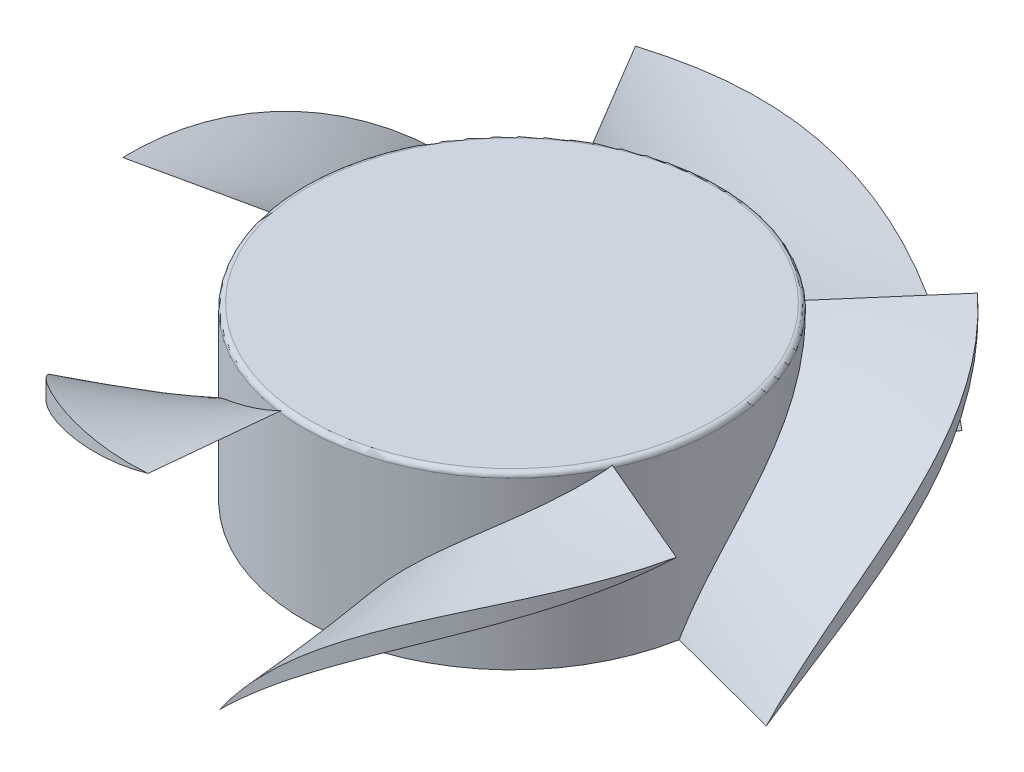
ISO-10303-21;
HEADER;
FILE_DESCRIPTION(('STEP AP214'),'2;1');
FILE_NAME('part.step','',(''),(''),'','','');
FILE_SCHEMA(('AUTOMOTIVE_DESIGN { 1 0 10303 214 1 1 1 1 }'));
ENDSEC;
DATA;
#1=APPLICATION_CONTEXT('core data for automotive mechanical design processes');
#2=APPLICATION_PROTOCOL_DEFINITION('international standard','automotive_design',2000,#1);
#3=PRODUCT_CONTEXT('',#1,'mechanical');
#4=PRODUCT('Part','Part','',(#3));
#5=PRODUCT_RELATED_PRODUCT_CATEGORY('part','',(#4));
#6=PRODUCT_DEFINITION_FORMATION('','',#4);
#7=PRODUCT_DEFINITION_CONTEXT('part definition',#1,'design');
#8=PRODUCT_DEFINITION('design','',#6,#7);
#9=PRODUCT_DEFINITION_SHAPE('','',#8);
#10=(LENGTH_UNIT() NAMED_UNIT(*) SI_UNIT(.MILLI.,.METRE.));
#11=(NAMED_UNIT(*) PLANE_ANGLE_UNIT() SI_UNIT($,.RADIAN.));
#12=(NAMED_UNIT(*) SI_UNIT($,.STERADIAN.) SOLID_ANGLE_UNIT());
#13=UNCERTAINTY_MEASURE_WITH_UNIT(LENGTH_MEASURE(1.E-05),#10,'distance_accuracy_value','');
#14=(GEOMETRIC_REPRESENTATION_CONTEXT(3) GLOBAL_UNCERTAINTY_ASSIGNED_CONTEXT((#13)) GLOBAL_UNIT_ASSIGNED_CONTEXT((#10,
#11,#12)) REPRESENTATION_CONTEXT('',''));
#15=CARTESIAN_POINT('',(0.,0.,0.));
#16=DIRECTION('',(0.,0.,1.));
#17=DIRECTION('',(1.,0.,0.));
#18=AXIS2_PLACEMENT_3D('',#15,#16,#17);
#19=CARTESIAN_POINT('',(0.,7.,0.));
#20=DIRECTION('',(0.,-1.,0.));
#21=DIRECTION('',(0.,0.,-1.));
#22=AXIS2_PLACEMENT_3D('',#19,#20,#21);
#23=CYLINDRICAL_SURFACE('',#22,8.5);
#24=CARTESIAN_POINT('',(4.02647889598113,0.,-7.48581777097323));
#25=CARTESIAN_POINT('',(3.96093130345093,0.159037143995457,-7.52106815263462));
#26=CARTESIAN_POINT('',(3.89095917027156,0.315964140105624,-7.5576012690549));
#27=CARTESIAN_POINT('',(3.74225899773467,0.625149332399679,-7.63232896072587));
#28=CARTESIAN_POINT('',(3.66353344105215,0.777408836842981,-7.67052306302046));
#29=CARTESIAN_POINT('',(3.49739048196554,1.07688646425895,-7.74768593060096));
#30=CARTESIAN_POINT('',(3.409973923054,1.2241050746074,-7.78665462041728));
#31=CARTESIAN_POINT('',(3.22690900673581,1.512782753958,-7.86428097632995));
#32=CARTESIAN_POINT('',(3.13128536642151,1.6542573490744,-7.90293921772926));
#33=CARTESIAN_POINT('',(2.93186912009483,1.93166043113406,-7.97906813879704));
#34=CARTESIAN_POINT('',(2.82807659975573,2.06758897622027,-8.01653883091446));
#35=CARTESIAN_POINT('',(2.61270888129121,2.33372768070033,-8.08929406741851));
#36=CARTESIAN_POINT('',(2.50113379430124,2.4639379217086,-8.12457864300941));
#37=CARTESIAN_POINT('',(2.21281574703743,2.78243499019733,-8.20889246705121));
#38=CARTESIAN_POINT('',(2.03145311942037,2.96709807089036,-8.25594022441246));
#39=CARTESIAN_POINT('',(1.65410478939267,3.32332173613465,-8.33974183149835));
#40=CARTESIAN_POINT('',(1.4581188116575,3.49488207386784,-8.37649548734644));
#41=CARTESIAN_POINT('',(1.05406566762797,3.82514789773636,-8.43686019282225));
#42=CARTESIAN_POINT('',(0.846012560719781,3.98386784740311,-8.4604862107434));
#43=CARTESIAN_POINT('',(0.420300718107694,4.28950653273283,-8.49228496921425));
#44=CARTESIAN_POINT('',(0.202642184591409,4.43642551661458,-8.50045803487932));
#45=CARTESIAN_POINT('',(-0.243920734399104,4.72272025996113,-8.4994924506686));
#46=CARTESIAN_POINT('',(-0.472964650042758,4.86187688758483,-8.48999190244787));
#47=CARTESIAN_POINT('',(-0.93468009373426,5.1312274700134,-8.45162951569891));
#48=CARTESIAN_POINT('',(-1.16735196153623,5.26142057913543,-8.42276585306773));
#49=CARTESIAN_POINT('',(-1.6330522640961,5.51546252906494,-8.34499297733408));
#50=CARTESIAN_POINT('',(-1.86608083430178,5.63930596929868,-8.29606700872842));
#51=CARTESIAN_POINT('',(-2.32874054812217,5.88361006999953,-8.17826070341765));
#52=CARTESIAN_POINT('',(-2.558372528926,6.00407157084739,-8.10938537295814));
#53=CARTESIAN_POINT('',(-3.01793540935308,6.24909895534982,-7.95003062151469));
#54=CARTESIAN_POINT('',(-3.24765136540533,6.37367545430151,-7.85894329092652));
#55=CARTESIAN_POINT('',(-3.58371345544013,6.56401543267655,-7.7085709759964));
#56=CARTESIAN_POINT('',(-3.69422254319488,6.62798381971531,-7.65620845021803));
#57=CARTESIAN_POINT('',(-3.9120800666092,6.75772632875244,-7.5472174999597));
#58=CARTESIAN_POINT('',(-4.01942758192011,6.82350096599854,-7.49058785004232));
#59=CARTESIAN_POINT('',(-4.12496314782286,6.89046782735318,-7.43200370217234));
#60=B_SPLINE_CURVE_WITH_KNOTS('',3,(#24,#25,#26,#27,#28,#29,#30,#31,#32,#33,#34,#35,#36,#37,#38,
#39,#40,#41,#42,#43,#44,#45,#46,#47,#48,#49,#50,#51,#52,#53,#54,#55,#56,#57,#58,#59),
.UNSPECIFIED.,.F.,.F.,(4,2,2,2,2,2,2,2,2,2,2,2,2,2,2,2,2,4),(0.,0.526695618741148,
1.05324223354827,1.57973779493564,2.10469991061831,2.62965652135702,3.15460563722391,
3.94282387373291,4.73105695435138,5.51838942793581,6.30570533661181,7.10932063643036,
7.91301165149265,8.71737525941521,9.52153718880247,10.350831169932,10.7647545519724,
11.1787972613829),.UNSPECIFIED.);
#61=CARTESIAN_POINT('',(4.02647889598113,0.,-7.48581777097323));
#62=VERTEX_POINT('',#61);
#63=CARTESIAN_POINT('',(-3.98017330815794,6.8,-7.51054062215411));
#64=VERTEX_POINT('',#63);
#65=EDGE_CURVE('E593',#62,#64,#60,.T.);
#66=ORIENTED_EDGE('',*,*,#65,.T.);
#67=CARTESIAN_POINT('',(0.,6.8,0.));
#68=DIRECTION('',(0.,1.,0.));
#69=DIRECTION('',(0.,0.,1.));
#70=AXIS2_PLACEMENT_3D('',#67,#68,#69);
#71=CIRCLE('',#70,8.5);
#72=CARTESIAN_POINT('',(5.87623194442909,6.8,-6.1416527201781));
#73=VERTEX_POINT('',#72);
#74=EDGE_CURVE('E445',#64,#73,#71,.F.);
#75=ORIENTED_EDGE('',*,*,#74,.T.);
#76=CARTESIAN_POINT('',(5.79357183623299,6.89046782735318,-6.21968852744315));
#77=CARTESIAN_POINT('',(5.88202119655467,6.79343129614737,-6.13731861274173));
#78=CARTESIAN_POINT('',(5.96967029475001,6.69807171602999,-6.05213241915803));
#79=CARTESIAN_POINT('',(6.14263725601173,6.51034701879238,-5.87648887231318));
#80=CARTESIAN_POINT('',(6.22795699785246,6.41797947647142,-5.7860359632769));
#81=CARTESIAN_POINT('',(6.39565096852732,6.23575519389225,-5.60011887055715));
#82=CARTESIAN_POINT('',(6.4780263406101,6.14589748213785,-5.50465666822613));
#83=CARTESIAN_POINT('',(6.63927247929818,5.96816977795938,-5.30906016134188));
#84=CARTESIAN_POINT('',(6.71814353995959,5.88029961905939,-5.20892625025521));
#85=CARTESIAN_POINT('',(6.87155576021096,5.70637931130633,-5.00479360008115));
#86=CARTESIAN_POINT('',(6.94611298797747,5.62032328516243,-4.90081193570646));
#87=CARTESIAN_POINT('',(7.09079216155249,5.44915958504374,-4.68904175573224));
#88=CARTESIAN_POINT('',(7.16091387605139,5.36405196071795,-4.58125304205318));
#89=CARTESIAN_POINT('',(7.29634281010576,5.19428761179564,-4.36233287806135));
#90=CARTESIAN_POINT('',(7.36164972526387,5.10963091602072,-4.25120121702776));
#91=CARTESIAN_POINT('',(7.48713711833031,4.94029809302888,-4.02608875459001));
#92=CARTESIAN_POINT('',(7.54731731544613,4.85562196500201,-3.91210779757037));
#93=CARTESIAN_POINT('',(7.68906124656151,4.64628278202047,-3.62820637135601));
#94=CARTESIAN_POINT('',(7.76754427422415,4.52134789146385,-3.4569363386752));
#95=CARTESIAN_POINT('',(7.91245398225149,4.26919371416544,-3.11098986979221));
#96=CARTESIAN_POINT('',(7.9788794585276,4.14197420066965,-2.93631309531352));
#97=CARTESIAN_POINT('',(8.09945191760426,3.88414752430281,-2.58521388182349));
#98=CARTESIAN_POINT('',(8.15359843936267,3.75354023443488,-2.4087913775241));
#99=CARTESIAN_POINT('',(8.24957684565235,3.48823168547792,-2.05616558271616));
#100=CARTESIAN_POINT('',(8.29142954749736,3.35353777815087,-1.87996243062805));
#101=CARTESIAN_POINT('',(8.36324740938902,3.07907257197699,-1.52910422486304));
#102=CARTESIAN_POINT('',(8.39321296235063,2.93930144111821,-1.35444912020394));
#103=CARTESIAN_POINT('',(8.44179487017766,2.65405741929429,-1.00828473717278));
#104=CARTESIAN_POINT('',(8.46041313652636,2.50858549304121,-0.836774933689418));
#105=CARTESIAN_POINT('',(8.48430190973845,2.24229955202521,-0.533578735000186));
#106=CARTESIAN_POINT('',(8.49154234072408,2.12264457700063,-0.40102416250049));
#107=CARTESIAN_POINT('',(8.49985990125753,1.87921949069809,-0.139577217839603));
#108=CARTESIAN_POINT('',(8.50093785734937,1.75544993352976,-0.010684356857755));
#109=CARTESIAN_POINT('',(8.49747845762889,1.50361070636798,0.242724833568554));
#110=CARTESIAN_POINT('',(8.49294169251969,1.37554149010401,0.367241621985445));
#111=CARTESIAN_POINT('',(8.47882476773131,1.11395452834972,0.612117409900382));
#112=CARTESIAN_POINT('',(8.4692072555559,0.980403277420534,0.732438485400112));
#113=CARTESIAN_POINT('',(8.44561219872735,0.708584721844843,0.967232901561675));
#114=CARTESIAN_POINT('',(8.4316339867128,0.57031669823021,1.08170534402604));
#115=CARTESIAN_POINT('',(8.40012303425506,0.288865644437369,1.30407663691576));
#116=CARTESIAN_POINT('',(8.38258840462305,0.145680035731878,1.41197195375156));
#117=CARTESIAN_POINT('',(8.36368617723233,1.05080729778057E-13,1.51616408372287));
#118=B_SPLINE_CURVE_WITH_KNOTS('',3,(#76,#77,#78,#79,#80,#81,#82,#83,#84,#85,#86,#87,#88,#89,
#90,#91,#92,#93,#94,#95,#96,#97,#98,#99,#100,#101,#102,#103,#104,#105,#106,#107,#108,#109,#110,
#111,#112,#113,#114,#115,#116,#117),.UNSPECIFIED.,.F.,.F.,(4,2,2,2,2,2,2,2,2,2,2,2,2,2,2,2,2,2,
2,2,4),(0.,0.464941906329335,0.929497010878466,1.39386973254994,1.85820341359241,
2.3206784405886,2.78317756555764,3.2457059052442,3.70825956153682,4.38605556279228,
5.06391921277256,5.74180831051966,6.41854282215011,7.09525496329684,7.77185307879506,
8.30782852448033,8.8437320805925,9.37957926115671,9.91942184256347,10.4593470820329,
10.9995598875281),.UNSPECIFIED.);
#119=CARTESIAN_POINT('',(8.36368617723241,0.,1.51616408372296));
#120=VERTEX_POINT('',#119);
#121=EDGE_CURVE('E180',#73,#120,#118,.T.);
#122=ORIENTED_EDGE('',*,*,#121,.T.);
#123=CARTESIAN_POINT('',(0.,0.,0.));
#124=DIRECTION('',(0.,1.,0.));
#125=DIRECTION('',(0.,0.,1.));
#126=AXIS2_PLACEMENT_3D('',#123,#124,#125);
#127=CIRCLE('',#126,8.5);
#128=EDGE_CURVE('E626',#120,#62,#127,.T.);
#129=ORIENTED_EDGE('',*,*,#128,.T.);
#130=EDGE_LOOP('',(#66,#75,#122,#129));
#131=FACE_BOUND('',#130,.T.);
#132=ADVANCED_FACE('F43',(#131),#23,.T.);
#133=CARTESIAN_POINT('',(8.36368617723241,0.,1.51616408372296));
#134=CARTESIAN_POINT('',(8.37695596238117,0.159037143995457,1.44293165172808));
#135=CARTESIAN_POINT('',(8.39007844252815,0.315964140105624,1.36509484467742));
#136=CARTESIAN_POINT('',(8.41519782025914,0.625149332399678,1.20058044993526));
#137=CARTESIAN_POINT('',(8.42719503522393,0.77740883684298,1.11390536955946));
#138=CARTESIAN_POINT('',(8.44924028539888,1.07688646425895,0.932049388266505));
#139=CARTESIAN_POINT('',(8.45928850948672,1.2241050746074,0.836869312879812));
#140=CARTESIAN_POINT('',(8.47654539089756,1.512782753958,0.638776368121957));
#141=CARTESIAN_POINT('',(8.48376223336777,1.6542573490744,0.535886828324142));
#142=CARTESIAN_POINT('',(8.4945421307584,1.93166043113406,0.322705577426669));
#143=CARTESIAN_POINT('',(8.49810522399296,2.06758897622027,0.212413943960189));
#144=CARTESIAN_POINT('',(8.50074728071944,2.33372768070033,-0.014895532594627));
#145=CARTESIAN_POINT('',(8.49982630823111,2.4639379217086,-0.131913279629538));
#146=CARTESIAN_POINT('',(8.49091834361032,2.78243499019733,-0.432174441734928));
#147=CARTESIAN_POINT('',(8.47961928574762,2.96709807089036,-0.6191991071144));
#148=CARTESIAN_POINT('',(8.4427123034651,3.32332173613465,-1.00397481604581));
#149=CARTESIAN_POINT('',(8.41710410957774,3.49488207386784,-1.20172606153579));
#150=CARTESIAN_POINT('',(8.34965506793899,3.82514789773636,-1.60465715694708));
#151=CARTESIAN_POINT('',(8.30783280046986,3.98386784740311,-1.80982826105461));
#152=CARTESIAN_POINT('',(8.20652302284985,4.28950653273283,-2.22453063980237));
#153=CARTESIAN_POINT('',(8.14703588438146,4.43642551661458,-2.43406182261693));
#154=CARTESIAN_POINT('',(8.00812202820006,4.72272025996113,-2.85847001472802));
#155=CARTESIAN_POINT('',(7.92830800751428,4.86187688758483,-3.07336789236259));
#156=CARTESIAN_POINT('',(7.74914529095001,5.1312274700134,-3.50063074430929));
#157=CARTESIAN_POINT('',(7.64979475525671,5.26142057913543,-3.71299547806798));
#158=CARTESIAN_POINT('',(7.43191904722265,5.51546252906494,-4.13186964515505));
#159=CARTESIAN_POINT('',(7.31337789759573,5.63930596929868,-4.3383740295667));
#160=CARTESIAN_POINT('',(7.05836772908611,5.88361006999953,-4.74198541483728));
#161=CARTESIAN_POINT('',(6.92190321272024,6.00407157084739,-4.93909475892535));
#162=CARTESIAN_POINT('',(6.62833509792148,6.24909895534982,-5.32692170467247));
#163=CARTESIAN_POINT('',(6.47071976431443,6.37367545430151,-5.51724702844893));
#164=CARTESIAN_POINT('',(6.22385829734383,6.56401543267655,-5.79039346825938));
#165=CARTESIAN_POINT('',(6.13990938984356,6.62798381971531,-5.87931294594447));
#166=CARTESIAN_POINT('',(5.9689311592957,6.75772632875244,-6.05282770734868));
#167=CARTESIAN_POINT('',(5.88190095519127,6.82350096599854,-6.13742173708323));
#168=CARTESIAN_POINT('',(5.79357183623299,6.89046782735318,-6.21968852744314));
#169=B_SPLINE_CURVE_WITH_KNOTS('',3,(#133,#134,#135,#136,#137,#138,#139,#140,#141,#142,#143,
#144,#145,#146,#147,#148,#149,#150,#151,#152,#153,#154,#155,#156,#157,#158,#159,#160,#161,#162,
#163,#164,#165,#166,#167,#168),.UNSPECIFIED.,.F.,.F.,(4,2,2,2,2,2,2,2,2,2,2,2,2,2,2,2,2,4),(0.,
0.526695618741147,1.05324223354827,1.57973779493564,2.10469991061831,2.62965652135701,
3.15460563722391,3.94282387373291,4.73105695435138,5.51838942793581,6.30570533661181,
7.10932063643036,7.91301165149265,8.71737525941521,9.52153718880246,10.350831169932,
10.7647545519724,11.1787972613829),.UNSPECIFIED.);
#170=CARTESIAN_POINT('',(5.91300740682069,6.8,-6.10625444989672));
#171=VERTEX_POINT('',#170);
#172=EDGE_CURVE('E184',#120,#171,#169,.T.);
#173=ORIENTED_EDGE('',*,*,#172,.T.);
#174=CARTESIAN_POINT('',(0.,6.8,0.));
#175=DIRECTION('',(0.,1.,0.));
#176=DIRECTION('',(0.,0.,1.));
#177=AXIS2_PLACEMENT_3D('',#174,#175,#176);
#178=CIRCLE('',#177,8.5);
#179=CARTESIAN_POINT('',(7.65691437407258,6.80000000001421,3.69075361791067));
#180=VERTEX_POINT('',#179);
#181=EDGE_CURVE('E442',#171,#180,#178,.F.);
#182=ORIENTED_EDGE('',*,*,#181,.T.);
#183=CARTESIAN_POINT('',(7.70558745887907,6.89046782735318,3.58802479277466));
#184=CARTESIAN_POINT('',(7.65458137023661,6.79343129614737,3.69759883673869));
#185=CARTESIAN_POINT('',(7.60064954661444,6.69807171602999,3.80728206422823));
#186=CARTESIAN_POINT('',(7.48705233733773,6.51034701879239,4.02606026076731));
#187=CARTESIAN_POINT('',(7.42739175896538,6.41797947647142,4.13515564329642));
#188=CARTESIAN_POINT('',(7.30239438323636,6.23575519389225,4.35209362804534));
#189=CARTESIAN_POINT('',(7.23705982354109,6.14589748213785,4.45993670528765));
#190=CARTESIAN_POINT('',(7.10086428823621,5.96816977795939,4.67373354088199));
#191=CARTESIAN_POINT('',(7.03000377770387,5.88029961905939,4.77968745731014));
#192=CARTESIAN_POINT('',(6.88326907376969,5.70637931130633,4.9886716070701));
#193=CARTESIAN_POINT('',(6.80741608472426,5.62032328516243,5.09171184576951));
#194=CARTESIAN_POINT('',(6.65071899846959,5.44915958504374,5.29475050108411));
#195=CARTESIAN_POINT('',(6.56987464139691,5.36405196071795,5.39474875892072));
#196=CARTESIAN_POINT('',(6.40351903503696,5.19428761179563,5.59119938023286));
#197=CARTESIAN_POINT('',(6.31800749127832,5.10963091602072,5.68765151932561));
#198=CARTESIAN_POINT('',(6.14269055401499,4.94029809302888,5.8765606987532));
#199=CARTESIAN_POINT('',(6.05288492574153,4.85562196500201,5.96901752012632));
#200=CARTESIAN_POINT('',(5.82667990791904,4.64628278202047,6.19155437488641));
#201=CARTESIAN_POINT('',(5.68804501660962,4.52134789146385,6.31912152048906));
#202=CARTESIAN_POINT('',(5.40380993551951,4.26919371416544,6.56384218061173));
#203=CARTESIAN_POINT('',(5.25820905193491,4.14197420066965,6.68099465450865));
#204=CARTESIAN_POINT('',(4.96155279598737,3.88414752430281,6.90416150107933));
#205=CARTESIAN_POINT('',(4.81049721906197,3.75354023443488,7.01017545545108));
#206=CARTESIAN_POINT('',(4.50478911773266,3.48823168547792,7.21042370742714));
#207=CARTESIAN_POINT('',(4.35014315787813,3.35353777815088,7.30467776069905));
#208=CARTESIAN_POINT('',(4.03865011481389,3.079072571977,7.48140175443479));
#209=CARTESIAN_POINT('',(3.88180310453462,2.93930144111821,7.56387208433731));
#210=CARTESIAN_POINT('',(3.56759384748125,2.6540574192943,7.71704690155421));
#211=CARTESIAN_POINT('',(3.41023169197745,2.50858549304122,7.78775336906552));
#212=CARTESIAN_POINT('',(3.12925700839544,2.24229955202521,7.90416572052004));
#213=CARTESIAN_POINT('',(3.00542753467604,2.12264457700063,7.95201339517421));
#214=CARTESIAN_POINT('',(2.75934698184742,1.8792194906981,8.04071541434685));
#215=CARTESIAN_POINT('',(2.63709569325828,1.75544993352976,8.08157069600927));
#216=CARTESIAN_POINT('',(2.3950202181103,1.50361070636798,8.15658835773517));
#217=CARTESIAN_POINT('',(2.27519577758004,1.37554149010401,8.19075144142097));
#218=CARTESIAN_POINT('',(2.0379426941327,1.11395452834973,8.25299622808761));
#219=CARTESIAN_POINT('',(1.92053857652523,0.980403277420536,8.28103068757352));
#220=CARTESIAN_POINT('',(1.6899445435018,0.708584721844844,8.33114591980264));
#221=CARTESIAN_POINT('',(1.57675527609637,0.570316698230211,8.35322578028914));
#222=CARTESIAN_POINT('',(1.35553018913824,0.28886564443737,8.39197359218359));
#223=CARTESIAN_POINT('',(1.24749714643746,0.145680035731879,8.40863865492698));
#224=CARTESIAN_POINT('',(1.14256343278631,1.05772050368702E-13,8.42285870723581));
#225=B_SPLINE_CURVE_WITH_KNOTS('',3,(#183,#184,#185,#186,#187,#188,#189,#190,#191,#192,#193,
#194,#195,#196,#197,#198,#199,#200,#201,#202,#203,#204,#205,#206,#207,#208,#209,#210,#211,#212,
#213,#214,#215,#216,#217,#218,#219,#220,#221,#222,#223,#224),.UNSPECIFIED.,.F.,.F.,(4,2,2,2,2,2,
2,2,2,2,2,2,2,2,2,2,2,2,2,2,4),(0.,0.464941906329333,0.929497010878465,1.39386973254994,
1.85820341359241,2.3206784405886,2.78317756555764,3.2457059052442,3.70825956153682,
4.38605556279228,5.06391921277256,5.74180831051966,6.41854282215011,7.09525496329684,
7.77185307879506,8.30782852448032,8.8437320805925,9.37957926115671,9.91942184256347,
10.4593470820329,10.9995598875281),.UNSPECIFIED.);
#226=CARTESIAN_POINT('',(1.14256343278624,0.,8.42285870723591));
#227=VERTEX_POINT('',#226);
#228=EDGE_CURVE('E481',#180,#227,#225,.T.);
#229=ORIENTED_EDGE('',*,*,#228,.T.);
#230=EDGE_CURVE('E533',#227,#120,#127,.T.);
#231=ORIENTED_EDGE('',*,*,#230,.T.);
#232=EDGE_LOOP('',(#173,#182,#229,#231));
#233=FACE_BOUND('',#232,.T.);
#234=ADVANCED_FACE('F389',(#233),#23,.T.);
#235=CARTESIAN_POINT('',(1.14256343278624,0.,8.42285870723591));
#236=CARTESIAN_POINT('',(1.21631220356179,0.159037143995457,8.41284895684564));
#237=CARTESIAN_POINT('',(1.29439447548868,0.315964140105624,8.40127628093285));
#238=CARTESIAN_POINT('',(1.45861927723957,0.625149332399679,8.37432848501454));
#239=CARTESIAN_POINT('',(1.54475952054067,0.77740883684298,8.35895444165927));
#240=CARTESIAN_POINT('',(1.72452719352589,1.07688646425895,8.32372413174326));
#241=CARTESIAN_POINT('',(1.8181538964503,1.2241050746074,8.30386829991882));
#242=CARTESIAN_POINT('',(2.01188415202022,1.512782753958,8.25906648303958));
#243=CARTESIAN_POINT('',(2.11196804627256,1.6542573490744,8.234135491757));
#244=CARTESIAN_POINT('',(2.31804663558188,1.93166043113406,8.17851115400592));
#245=CARTESIAN_POINT('',(2.42404126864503,2.06758897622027,8.14781786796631));
#246=CARTESIAN_POINT('',(2.64104186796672,2.33372768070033,8.08008812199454));
#247=CARTESIAN_POINT('',(2.7520477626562,2.4639379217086,8.04305175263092));
#248=CARTESIAN_POINT('',(3.03486038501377,2.78243499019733,7.94179397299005));
#249=CARTESIAN_POINT('',(3.20923981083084,2.96709807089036,7.8732541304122));
#250=CARTESIAN_POINT('',(3.56377837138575,3.32332173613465,7.71925127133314));
#251=CARTESIAN_POINT('',(3.74393761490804,3.49488207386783,7.6337879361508));
#252=CARTESIAN_POINT('',(4.10630495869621,3.82514789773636,7.4451275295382));
#253=CARTESIAN_POINT('',(4.28851048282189,3.98386784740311,7.34195083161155));
#254=CARTESIAN_POINT('',(4.65160943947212,4.28950653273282,7.11744942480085));
#255=CARTESIAN_POINT('',(4.83250289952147,4.43642551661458,6.99612509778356));
#256=CARTESIAN_POINT('',(5.19321233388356,4.72272025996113,6.73286082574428));
#257=CARTESIAN_POINT('',(5.37292847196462,4.86187688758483,6.59054608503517));
#258=CARTESIAN_POINT('',(5.72391526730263,5.1312274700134,6.28812073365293));
#259=CARTESIAN_POINT('',(5.89518512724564,5.26142057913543,6.12800844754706));
#260=CARTESIAN_POINT('',(6.22623083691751,5.51546252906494,5.79135709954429));
#261=CARTESIAN_POINT('',(6.38599694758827,5.63930596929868,5.61480440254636));
#262=CARTESIAN_POINT('',(6.69105170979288,5.88361006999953,5.24755254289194));
#263=CARTESIAN_POINT('',(6.83634398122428,6.00407157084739,5.05685693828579));
#264=CARTESIAN_POINT('',(7.11447178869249,6.24909895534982,4.65781195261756));
#265=CARTESIAN_POINT('',(7.24677611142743,6.37367545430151,4.4490971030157));
#266=CARTESIAN_POINT('',(7.43026942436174,6.56401543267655,4.12991100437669));
#267=CARTESIAN_POINT('',(7.4888952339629,6.62798381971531,4.02259321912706));
#268=CARTESIAN_POINT('',(7.60108239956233,6.75772632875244,3.80636424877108));
#269=CARTESIAN_POINT('',(7.65464229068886,6.82350096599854,3.69745261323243));
#270=CARTESIAN_POINT('',(7.70558745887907,6.89046782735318,3.58802479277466));
#271=B_SPLINE_CURVE_WITH_KNOTS('',3,(#235,#236,#237,#238,#239,#240,#241,#242,#243,#244,#245,
#246,#247,#248,#249,#250,#251,#252,#253,#254,#255,#256,#257,#258,#259,#260,#261,#262,#263,#264,
#265,#266,#267,#268,#269,#270),.UNSPECIFIED.,.F.,.F.,(4,2,2,2,2,2,2,2,2,2,2,2,2,2,2,2,2,4),(0.,
0.526695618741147,1.05324223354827,1.57973779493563,2.10469991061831,2.62965652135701,
3.15460563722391,3.94282387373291,4.73105695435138,5.51838942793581,6.30570533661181,
7.10932063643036,7.91301165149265,8.7173752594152,9.52153718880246,10.350831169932,
10.7647545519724,11.1787972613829),.UNSPECIFIED.);
#272=CARTESIAN_POINT('',(7.63461286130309,6.8,3.73666782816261));
#273=VERTEX_POINT('',#272);
#274=EDGE_CURVE('E489',#227,#273,#271,.T.);
#275=ORIENTED_EDGE('',*,*,#274,.T.);
#276=CARTESIAN_POINT('',(0.,6.8,0.));
#277=DIRECTION('',(0.,1.,0.));
#278=DIRECTION('',(0.,0.,1.));
#279=AXIS2_PLACEMENT_3D('',#276,#277,#278);
#280=CIRCLE('',#279,8.5);
#281=CARTESIAN_POINT('',(-1.14399861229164,6.80000000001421,8.42266390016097));
#282=VERTEX_POINT('',#281);
#283=EDGE_CURVE('E434',#273,#282,#280,.F.);
#284=ORIENTED_EDGE('',*,*,#283,.T.);
#285=CARTESIAN_POINT('',(-1.03125688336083,6.89046782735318,8.43720980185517));
#286=CARTESIAN_POINT('',(-1.15122974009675,6.79343129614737,8.4225603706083));
#287=CARTESIAN_POINT('',(-1.27221053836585,6.69807171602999,8.40516213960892));
#288=CARTESIAN_POINT('',(-1.51538443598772,6.51034701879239,8.36473095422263));
#289=CARTESIAN_POINT('',(-1.63757644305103,6.41797947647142,8.341702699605));
#290=CARTESIAN_POINT('',(-1.88252304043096,6.23575519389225,8.289860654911));
#291=CARTESIAN_POINT('',(-2.00527739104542,6.14589748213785,8.26104913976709));
#292=CARTESIAN_POINT('',(-2.25069699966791,5.96816977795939,8.19758634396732));
#293=CARTESIAN_POINT('',(-2.37336226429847,5.8802996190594,8.16293555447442));
#294=CARTESIAN_POINT('',(-2.61746151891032,5.70637931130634,8.087962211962));
#295=CARTESIAN_POINT('',(-2.73889847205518,5.62032328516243,8.04766291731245));
#296=CARTESIAN_POINT('',(-2.98042177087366,5.44915958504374,7.96137752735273));
#297=CARTESIAN_POINT('',(-3.10050804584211,5.36405196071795,7.91539113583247));
#298=CARTESIAN_POINT('',(-3.33875039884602,5.19428761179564,7.81788413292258));
#299=CARTESIAN_POINT('',(-3.45690635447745,5.10963091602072,7.76636317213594));
#300=CARTESIAN_POINT('',(-3.69074557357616,4.94029809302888,7.65800300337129));
#301=CARTESIAN_POINT('',(-3.80642870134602,4.85562196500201,7.60116350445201));
#302=CARTESIAN_POINT('',(-4.08797502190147,4.64628278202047,7.45479741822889));
#303=CARTESIAN_POINT('',(-4.25213912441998,4.52134789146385,7.36236821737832));
#304=CARTESIAN_POINT('',(-4.57271577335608,4.26919371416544,7.16766743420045));
#305=CARTESIAN_POINT('',(-4.7291275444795,4.14197420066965,7.0653948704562));
#306=CARTESIAN_POINT('',(-5.03304365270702,3.88414752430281,6.85222035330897));
#307=CARTESIAN_POINT('',(-5.18054765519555,3.75354023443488,6.7413180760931));
#308=CARTESIAN_POINT('',(-5.46546405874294,3.48823168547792,6.51245250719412));
#309=CARTESIAN_POINT('',(-5.6028932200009,3.35353777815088,6.3945015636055));
#310=CARTESIAN_POINT('',(-5.8672243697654,3.07907257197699,6.15286479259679));
#311=CARTESIAN_POINT('',(-5.99412670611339,2.93930144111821,6.02917915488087));
#312=CARTESIAN_POINT('',(-6.23690061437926,2.65405741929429,5.77768201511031));
#313=CARTESIAN_POINT('',(-6.35277404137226,2.50858549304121,5.64987121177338));
#314=CARTESIAN_POINT('',(-6.55031471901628,2.24229955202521,5.41862180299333));
#315=CARTESIAN_POINT('',(-6.6340859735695,2.12264457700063,5.31563871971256));
#316=CARTESIAN_POINT('',(-6.7944896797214,1.87921949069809,5.10901263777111));
#317=CARTESIAN_POINT('',(-6.8711230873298,1.75544993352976,5.00536972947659));
#318=CARTESIAN_POINT('',(-7.01727455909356,1.50361070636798,4.79832400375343));
#319=CARTESIAN_POINT('',(-7.086793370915,1.37554149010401,4.69492116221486));
#320=CARTESIAN_POINT('',(-7.21930691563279,1.11395452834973,4.48851476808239));
#321=CARTESIAN_POINT('',(-7.28224913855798,0.980403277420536,4.38551994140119));
#322=CARTESIAN_POINT('',(-7.40116903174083,0.708584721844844,4.18169844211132));
#323=CARTESIAN_POINT('',(-7.45714563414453,0.57031669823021,4.08087210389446));
#324=CARTESIAN_POINT('',(-7.56235930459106,0.288865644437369,3.8824482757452));
#325=CARTESIAN_POINT('',(-7.6115927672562,0.145680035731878,3.78485253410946));
#326=CARTESIAN_POINT('',(-7.65754314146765,1.05080729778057E-13,3.68944887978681));
#327=B_SPLINE_CURVE_WITH_KNOTS('',3,(#285,#286,#287,#288,#289,#290,#291,#292,#293,#294,#295,
#296,#297,#298,#299,#300,#301,#302,#303,#304,#305,#306,#307,#308,#309,#310,#311,#312,#313,#314,
#315,#316,#317,#318,#319,#320,#321,#322,#323,#324,#325,#326),.UNSPECIFIED.,.F.,.F.,(4,2,2,2,2,2,
2,2,2,2,2,2,2,2,2,2,2,2,2,2,4),(0.,0.464941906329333,0.929497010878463,1.39386973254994,
1.85820341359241,2.3206784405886,2.78317756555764,3.2457059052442,3.70825956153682,
4.38605556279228,5.06391921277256,5.74180831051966,6.41854282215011,7.09525496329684,
7.77185307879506,8.30782852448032,8.8437320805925,9.3795792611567,9.91942184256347,
10.4593470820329,10.9995598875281),.UNSPECIFIED.);
#328=CARTESIAN_POINT('',(-7.65754314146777,0.,3.68944887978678));
#329=VERTEX_POINT('',#328);
#330=EDGE_CURVE('E305',#282,#329,#327,.T.);
#331=ORIENTED_EDGE('',*,*,#330,.T.);
#332=EDGE_CURVE('E620',#329,#227,#127,.T.);
#333=ORIENTED_EDGE('',*,*,#332,.T.);
#334=EDGE_LOOP('',(#275,#284,#331,#333));
#335=FACE_BOUND('',#334,.T.);
#336=ADVANCED_FACE('F394',(#335),#23,.T.);
#337=CARTESIAN_POINT('',(-7.65754314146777,0.,3.68944887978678));
#338=CARTESIAN_POINT('',(-7.62523367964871,0.159037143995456,3.75649494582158));
#339=CARTESIAN_POINT('',(-7.59009866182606,0.315964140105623,3.82717944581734));
#340=CARTESIAN_POINT('',(-7.51372153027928,0.625149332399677,3.9750391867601));
#341=CARTESIAN_POINT('',(-7.47248114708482,0.777408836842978,4.05221258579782));
#342=CARTESIAN_POINT('',(-7.38342386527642,1.07688646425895,4.21229503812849));
#343=CARTESIAN_POINT('',(-7.33560760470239,1.22410507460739,4.29520353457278));
#344=CARTESIAN_POINT('',(-7.23313260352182,1.512782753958,4.46560743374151));
#345=CARTESIAN_POINT('',(-7.17849419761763,1.6542573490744,4.55308877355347));
#346=CARTESIAN_POINT('',(-7.06191052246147,1.93166043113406,4.73189229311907));
#347=CARTESIAN_POINT('',(-6.99996532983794,2.06758897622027,4.82321443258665));
#348=CARTESIAN_POINT('',(-6.86849364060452,2.33372768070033,5.00866462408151));
#349=CARTESIAN_POINT('',(-6.7989672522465,2.4639379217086,5.10279263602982));
#350=CARTESIAN_POINT('',(-6.61527147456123,2.78243499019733,5.3404730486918));
#351=CARTESIAN_POINT('',(-6.4962000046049,2.96709807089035,5.48513776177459));
#352=CARTESIAN_POINT('',(-6.24017614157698,3.32332173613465,5.77473446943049));
#353=CARTESIAN_POINT('',(-6.10322341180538,3.49488207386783,5.91966646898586));
#354=CARTESIAN_POINT('',(-5.81181903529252,3.82514789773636,6.20599902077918));
#355=CARTESIAN_POINT('',(-5.65738756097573,3.98386784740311,6.34740341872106));
#356=CARTESIAN_POINT('',(-5.33167028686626,4.28950653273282,6.62335629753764));
#357=CARTESIAN_POINT('',(-5.1603848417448,4.43642551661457,6.75790492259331));
#358=CARTESIAN_POINT('',(-4.79854029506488,4.72272025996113,7.01960684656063));
#359=CARTESIAN_POINT('',(-4.60765559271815,4.86187688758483,7.14654937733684));
#360=CARTESIAN_POINT('',(-4.21157110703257,5.1312274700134,7.38690308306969));
#361=CARTESIAN_POINT('',(-4.00636997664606,5.26142057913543,7.5003129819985));
#362=CARTESIAN_POINT('',(-3.58389676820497,5.51546252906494,7.7111251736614));
#363=CARTESIAN_POINT('',(-3.36661473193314,5.63930596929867,7.80851399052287));
#364=CARTESIAN_POINT('',(-2.92307035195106,5.88361006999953,7.98515124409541));
#365=CARTESIAN_POINT('',(-2.6968102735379,6.00407157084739,8.06440422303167));
#366=CARTESIAN_POINT('',(-2.2313497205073,6.24909895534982,8.2056078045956));
#367=CARTESIAN_POINT('',(-1.99196581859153,6.37367545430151,8.2669402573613));
#368=CARTESIAN_POINT('',(-1.63169924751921,6.56401543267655,8.34281883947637));
#369=CARTESIAN_POINT('',(-1.51151759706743,6.62798381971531,8.36541227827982));
#370=CARTESIAN_POINT('',(-1.27120388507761,6.75772632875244,8.40529018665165));
#371=CARTESIAN_POINT('',(-1.15107184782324,6.82350096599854,8.42257312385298));
#372=CARTESIAN_POINT('',(-1.03125688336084,6.89046782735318,8.43720980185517));
#373=B_SPLINE_CURVE_WITH_KNOTS('',3,(#337,#338,#339,#340,#341,#342,#343,#344,#345,#346,#347,
#348,#349,#350,#351,#352,#353,#354,#355,#356,#357,#358,#359,#360,#361,#362,#363,#364,#365,#366,
#367,#368,#369,#370,#371,#372),.UNSPECIFIED.,.F.,.F.,(4,2,2,2,2,2,2,2,2,2,2,2,2,2,2,2,2,4),(0.,
0.526695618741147,1.05324223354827,1.57973779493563,2.10469991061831,2.62965652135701,
3.1546056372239,3.94282387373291,4.73105695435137,5.51838942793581,6.30570533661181,
7.10932063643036,7.91301165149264,8.7173752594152,9.52153718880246,10.350831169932,
10.7647545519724,11.1787972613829),.UNSPECIFIED.);
#374=CARTESIAN_POINT('',(-1.19455716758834,6.8,8.41564217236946));
#375=VERTEX_POINT('',#374);
#376=EDGE_CURVE('E508',#329,#375,#373,.T.);
#377=ORIENTED_EDGE('',*,*,#376,.T.);
#378=CARTESIAN_POINT('',(0.,6.8,0.));
#379=DIRECTION('',(0.,1.,0.));
#380=DIRECTION('',(0.,0.,1.));
#381=AXIS2_PLACEMENT_3D('',#378,#379,#380);
#382=CIRCLE('',#381,8.5);
#383=CARTESIAN_POINT('',(-8.36394439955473,6.8,1.5147389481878));
#384=VERTEX_POINT('',#383);
#385=EDGE_CURVE('E429',#375,#384,#382,.F.);
#386=ORIENTED_EDGE('',*,*,#385,.T.);
#387=CARTESIAN_POINT('',(-8.34293926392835,6.89046782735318,1.62645763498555));
#388=CARTESIAN_POINT('',(-8.36608047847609,6.79343129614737,1.5078297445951));
#389=CARTESIAN_POINT('',(-8.38691890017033,6.69807171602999,1.38739381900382));
#390=CARTESIAN_POINT('',(-8.42361142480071,6.51034701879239,1.14362777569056));
#391=CARTESIAN_POINT('',(-8.43946965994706,6.41797947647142,1.02030014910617));
#392=CARTESIAN_POINT('',(-8.46585760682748,6.23575519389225,0.771322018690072));
#393=CARTESIAN_POINT('',(-8.47638940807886,6.14589748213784,0.645672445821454));
#394=CARTESIAN_POINT('',(-8.49187153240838,5.96816977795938,0.392653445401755));
#395=CARTESIAN_POINT('',(-8.49682232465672,5.88029961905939,0.265284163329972));
#396=CARTESIAN_POINT('',(-8.50094925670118,5.70637931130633,0.00996393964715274));
#397=CARTESIAN_POINT('',(-8.5001484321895,5.62032328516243,-0.117982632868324));
#398=CARTESIAN_POINT('',(-8.49272095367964,5.44915958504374,-0.374348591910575));
#399=CARTESIAN_POINT('',(-8.48609399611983,5.36405196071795,-0.502768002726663));
#400=CARTESIAN_POINT('',(-8.46698026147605,5.19428761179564,-0.759481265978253));
#401=CARTESIAN_POINT('',(-8.45449311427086,5.10963091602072,-0.887775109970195));
#402=CARTESIAN_POINT('',(-8.42369676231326,4.94029809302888,-1.14365455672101));
#403=CARTESIAN_POINT('',(-8.40538723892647,4.85562196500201,-1.27124012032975));
#404=CARTESIAN_POINT('',(-8.35318741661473,4.64628278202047,-1.58423619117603));
#405=CARTESIAN_POINT('',(-8.31601152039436,4.52134789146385,-1.76892772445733));
#406=CARTESIAN_POINT('',(-8.22990370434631,4.26919371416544,-2.13398008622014));
#407=CARTESIAN_POINT('',(-8.18097061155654,4.14197420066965,-2.3143404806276));
#408=CARTESIAN_POINT('',(-8.0721448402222,3.88414752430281,-2.66925642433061));
#409=CARTESIAN_POINT('',(-8.01225175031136,3.75354023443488,-2.84381175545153));
#410=CARTESIAN_POINT('',(-7.88263167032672,3.48823168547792,-3.18550670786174));
#411=CARTESIAN_POINT('',(-7.812921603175,3.35353777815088,-3.35265845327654));
#412=CARTESIAN_POINT('',(-7.66479419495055,3.079072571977,-3.67872218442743));
#413=CARTESIAN_POINT('',(-7.58637714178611,2.93930144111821,-3.8376344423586));
#414=CARTESIAN_POINT('',(-7.4222104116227,2.6540574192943,-4.14624304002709));
#415=CARTESIAN_POINT('',(-7.3364619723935,2.50858549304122,-4.29594092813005));
#416=CARTESIAN_POINT('',(-7.17757414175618,2.24229955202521,-4.55527327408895));
#417=CARTESIAN_POINT('',(-7.10551815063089,2.12264457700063,-4.6667679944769));
#418=CARTESIAN_POINT('',(-6.9585725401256,1.87921949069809,-4.88317195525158));
#419=CARTESIAN_POINT('',(-6.88368330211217,1.75544993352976,-4.9880820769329));
#420=CARTESIAN_POINT('',(-6.73193440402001,1.50361070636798,-5.1910610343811));
#421=CARTESIAN_POINT('',(-6.6550749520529,1.37554149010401,-5.28913058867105));
#422=CARTESIAN_POINT('',(-6.49971974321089,1.11395452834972,-5.47894154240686));
#423=CARTESIAN_POINT('',(-6.42121605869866,0.980403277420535,-5.57063030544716));
#424=CARTESIAN_POINT('',(-6.26411856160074,0.708584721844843,-5.74671415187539));
#425=CARTESIAN_POINT('',(-6.18552473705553,0.570316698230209,-5.83110811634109));
#426=CARTESIAN_POINT('',(-6.02932527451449,0.288865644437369,-5.99248859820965));
#427=CARTESIAN_POINT('',(-5.95172018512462,0.145680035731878,-6.06947114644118));
#428=CARTESIAN_POINT('',(-5.87518536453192,1.04389409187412E-13,-6.14265389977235));
#429=B_SPLINE_CURVE_WITH_KNOTS('',3,(#387,#388,#389,#390,#391,#392,#393,#394,#395,#396,#397,
#398,#399,#400,#401,#402,#403,#404,#405,#406,#407,#408,#409,#410,#411,#412,#413,#414,#415,#416,
#417,#418,#419,#420,#421,#422,#423,#424,#425,#426,#427,#428),.UNSPECIFIED.,.F.,.F.,(4,2,2,2,2,2,
2,2,2,2,2,2,2,2,2,2,2,2,2,2,4),(0.,0.464941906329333,0.929497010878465,1.39386973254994,
1.85820341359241,2.3206784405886,2.78317756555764,3.2457059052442,3.70825956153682,
4.38605556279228,5.06391921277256,5.74180831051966,6.41854282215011,7.09525496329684,
7.77185307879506,8.30782852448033,8.8437320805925,9.37957926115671,9.91942184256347,
10.4593470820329,10.9995598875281),.UNSPECIFIED.);
#430=CARTESIAN_POINT('',(-5.87518536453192,0.,-6.14265389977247));
#431=VERTEX_POINT('',#430);
#432=EDGE_CURVE('E364',#384,#431,#429,.T.);
#433=ORIENTED_EDGE('',*,*,#432,.T.);
#434=EDGE_CURVE('E621',#431,#329,#127,.T.);
#435=ORIENTED_EDGE('',*,*,#434,.T.);
#436=EDGE_LOOP('',(#377,#386,#433,#435));
#437=FACE_BOUND('',#436,.T.);
#438=ADVANCED_FACE('F399',(#437),#23,.T.);
#439=CARTESIAN_POINT('',(-5.87518536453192,0.,-6.14265389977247));
#440=CARTESIAN_POINT('',(-5.92896578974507,0.159037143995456,-6.09120740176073));
#441=CARTESIAN_POINT('',(-5.98533342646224,0.315964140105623,-6.03594930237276));
#442=CARTESIAN_POINT('',(-6.102354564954,0.625149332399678,-5.91761916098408));
#443=CARTESIAN_POINT('',(-6.16300684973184,0.77740883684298,-5.85454933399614));
#444=CARTESIAN_POINT('',(-6.2877340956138,1.07688646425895,-5.72038262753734));
#445=CARTESIAN_POINT('',(-6.35180872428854,1.2241050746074,-5.64928652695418));
#446=CARTESIAN_POINT('',(-6.48220594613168,1.512782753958,-5.49916930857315));
#447=CARTESIAN_POINT('',(-6.54852144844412,1.6542573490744,-5.42017187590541));
#448=CARTESIAN_POINT('',(-6.68254736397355,1.93166043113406,-5.25404088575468));
#449=CARTESIAN_POINT('',(-6.75025776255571,2.06758897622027,-5.16690741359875));
#450=CARTESIAN_POINT('',(-6.88600438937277,2.33372768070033,-4.98456314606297));
#451=CARTESIAN_POINT('',(-6.95404061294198,2.4639379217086,-4.88935246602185));
#452=CARTESIAN_POINT('',(-7.12332300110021,2.78243499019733,-4.64120011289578));
#453=CARTESIAN_POINT('',(-7.22411221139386,2.96709807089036,-4.48325256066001));
#454=CARTESIAN_POINT('',(-7.42041932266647,3.32332173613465,-4.15026909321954));
#455=CARTESIAN_POINT('',(-7.51593712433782,3.49488207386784,-3.9752328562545));
#456=CARTESIAN_POINT('',(-7.69820665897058,3.82514789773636,-3.60960920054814));
#457=CARTESIAN_POINT('',(-7.78496828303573,3.98386784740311,-3.41903977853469));
#458=CARTESIAN_POINT('',(-7.94676289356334,4.28950653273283,-3.02399011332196));
#459=CARTESIAN_POINT('',(-8.02179612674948,4.43642551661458,-2.8195101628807));
#460=CARTESIAN_POINT('',(-8.15887333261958,4.72272025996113,-2.39450520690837));
#461=CARTESIAN_POINT('',(-8.22061623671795,4.86187688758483,-2.17373566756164));
#462=CARTESIAN_POINT('',(-8.32680935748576,5.1312274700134,-1.72276355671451));
#463=CARTESIAN_POINT('',(-8.37125794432,5.26142057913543,-1.49256009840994));
#464=CARTESIAN_POINT('',(-8.44120085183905,5.51546252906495,-1.02561965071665));
#465=CARTESIAN_POINT('',(-8.46667927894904,5.63930596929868,-0.788877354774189));
#466=CARTESIAN_POINT('',(-8.49760853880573,5.88361006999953,-0.312457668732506));
#467=CARTESIAN_POINT('',(-8.50306439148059,6.00407157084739,-0.0727810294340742));
#468=CARTESIAN_POINT('',(-8.49352175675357,6.24909895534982,0.413532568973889));
#469=CARTESIAN_POINT('',(-8.47787869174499,6.37367545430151,0.660152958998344));
#470=CARTESIAN_POINT('',(-8.43871501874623,6.56401543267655,1.02623460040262));
#471=CARTESIAN_POINT('',(-8.42306448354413,6.62798381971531,1.14751589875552));
#472=CARTESIAN_POINT('',(-8.3867296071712,6.75772632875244,1.38839077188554));
#473=CARTESIAN_POINT('',(-8.36604381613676,6.82350096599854,1.50798385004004));
#474=CARTESIAN_POINT('',(-8.34293926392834,6.89046782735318,1.62645763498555));
#475=B_SPLINE_CURVE_WITH_KNOTS('',3,(#439,#440,#441,#442,#443,#444,#445,#446,#447,#448,#449,
#450,#451,#452,#453,#454,#455,#456,#457,#458,#459,#460,#461,#462,#463,#464,#465,#466,#467,#468,
#469,#470,#471,#472,#473,#474),.UNSPECIFIED.,.F.,.F.,(4,2,2,2,2,2,2,2,2,2,2,2,2,2,2,2,2,4),(0.,
0.526695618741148,1.05324223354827,1.57973779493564,2.10469991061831,2.62965652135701,
3.15460563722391,3.94282387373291,4.73105695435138,5.51838942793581,6.30570533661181,
7.10932063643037,7.91301165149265,8.71737525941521,9.52153718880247,10.350831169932,
10.7647545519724,11.1787972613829),.UNSPECIFIED.);
#476=CARTESIAN_POINT('',(-8.37288979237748,6.8,1.46448507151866));
#477=VERTEX_POINT('',#476);
#478=EDGE_CURVE('E412',#431,#477,#475,.T.);
#479=ORIENTED_EDGE('',*,*,#478,.T.);
#480=CARTESIAN_POINT('',(0.,6.8,0.));
#481=DIRECTION('',(0.,1.,0.));
#482=DIRECTION('',(0.,0.,1.));
#483=AXIS2_PLACEMENT_3D('',#480,#481,#482);
#484=CIRCLE('',#483,8.5);
#485=CARTESIAN_POINT('',(-4.02520330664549,6.80000000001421,-7.48650374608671));
#486=VERTEX_POINT('',#485);
#487=EDGE_CURVE('E414',#477,#486,#484,.F.);
#488=ORIENTED_EDGE('',*,*,#487,.T.);
#489=CARTESIAN_POINT('',(-4.12496314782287,6.89046782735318,-7.43200370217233));
#490=CARTESIAN_POINT('',(-4.01929234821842,6.79343129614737,-7.49067033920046));
#491=CARTESIAN_POINT('',(-3.91119040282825,6.69807171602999,-7.54770560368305));
#492=CARTESIAN_POINT('',(-3.69069373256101,6.51034701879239,-7.65793011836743));
#493=CARTESIAN_POINT('',(-3.57830265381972,6.41797947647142,-7.71112252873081));
#494=CARTESIAN_POINT('',(-3.34966470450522,6.23575519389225,-7.81315743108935));
#495=CARTESIAN_POINT('',(-3.23341936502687,6.14589748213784,-7.86200162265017));
#496=CARTESIAN_POINT('',(-2.99756823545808,5.96816977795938,-7.95491316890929));
#497=CARTESIAN_POINT('',(-2.87796272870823,5.88029961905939,-7.99898092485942));
#498=CARTESIAN_POINT('',(-2.63641405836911,5.70637931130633,-8.0818041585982));
#499=CARTESIAN_POINT('',(-2.51448216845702,5.62032328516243,-8.12058019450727));
#500=CARTESIAN_POINT('',(-2.26836843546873,5.44915958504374,-8.19273768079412));
#501=CARTESIAN_POINT('',(-2.14418647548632,5.36405196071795,-8.22611884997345));
#502=CARTESIAN_POINT('',(-1.8941311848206,5.19428761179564,-8.28726936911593));
#503=CARTESIAN_POINT('',(-1.76825774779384,5.10963091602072,-8.31503836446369));
#504=CARTESIAN_POINT('',(-1.51538533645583,4.94029809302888,-8.36482039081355));
#505=CARTESIAN_POINT('',(-1.38838630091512,4.85562196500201,-8.3868331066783));
#506=CARTESIAN_POINT('',(-1.07457871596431,4.64628278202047,-8.43390923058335));
#507=CARTESIAN_POINT('',(-0.887438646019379,4.52134789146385,-8.45562567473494));
#508=CARTESIAN_POINT('',(-0.513644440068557,4.26919371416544,-8.48653965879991));
#509=CARTESIAN_POINT('',(-0.326990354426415,4.14197420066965,-8.49573594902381));
#510=CARTESIAN_POINT('',(0.0441837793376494,3.88414752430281,-8.50191154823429));
#511=CARTESIAN_POINT('',(0.228703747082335,3.75354023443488,-8.49889039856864));
#512=CARTESIAN_POINT('',(0.593729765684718,3.48823168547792,-8.48120392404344));
#513=CARTESIAN_POINT('',(0.774242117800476,3.35353777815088,-8.46655844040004));
#514=CARTESIAN_POINT('',(1.13012104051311,3.079072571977,-8.42644013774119));
#515=CARTESIAN_POINT('',(1.30548778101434,2.93930144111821,-8.40096767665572));
#516=CARTESIAN_POINT('',(1.64972230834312,2.6540574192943,-8.34020113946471));
#517=CARTESIAN_POINT('',(1.81859118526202,2.50858549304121,-8.30490871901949));
#518=CARTESIAN_POINT('',(2.11432994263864,2.24229955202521,-8.23393551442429));
#519=CARTESIAN_POINT('',(2.24263424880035,2.12264457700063,-8.19985995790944));
#520=CARTESIAN_POINT('',(2.49385533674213,1.87921949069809,-8.12697887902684));
#521=CARTESIAN_POINT('',(2.61677283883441,1.75544993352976,-8.08817399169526));
#522=CARTESIAN_POINT('',(2.85671028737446,1.50361070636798,-8.00657616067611));
#523=CARTESIAN_POINT('',(2.97373085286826,1.37554149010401,-7.96378363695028));
#524=CARTESIAN_POINT('',(3.20225919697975,1.11395452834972,-7.87468686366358));
#525=CARTESIAN_POINT('',(3.3137193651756,0.980403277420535,-7.82835880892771));
#526=CARTESIAN_POINT('',(3.5297308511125,0.708584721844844,-7.7333631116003));
#527=CARTESIAN_POINT('',(3.63428110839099,0.570316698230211,-7.6846951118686));
#528=CARTESIAN_POINT('',(3.83603135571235,0.28886564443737,-7.58600990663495));
#529=CARTESIAN_POINT('',(3.93322740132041,0.14568003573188,-7.53599199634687));
#530=CARTESIAN_POINT('',(4.02647889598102,1.06463370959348E-13,-7.48581777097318));
#531=B_SPLINE_CURVE_WITH_KNOTS('',3,(#489,#490,#491,#492,#493,#494,#495,#496,#497,#498,#499,
#500,#501,#502,#503,#504,#505,#506,#507,#508,#509,#510,#511,#512,#513,#514,#515,#516,#517,#518,
#519,#520,#521,#522,#523,#524,#525,#526,#527,#528,#529,#530),.UNSPECIFIED.,.F.,.F.,(4,2,2,2,2,2,
2,2,2,2,2,2,2,2,2,2,2,2,2,2,4),(0.,0.464941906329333,0.929497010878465,1.39386973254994,
1.85820341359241,2.3206784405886,2.78317756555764,3.2457059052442,3.70825956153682,
4.38605556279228,5.06391921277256,5.74180831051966,6.41854282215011,7.09525496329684,
7.77185307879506,8.30782852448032,8.8437320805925,9.37957926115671,9.91942184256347,
10.4593470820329,10.9995598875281),.UNSPECIFIED.);
#532=EDGE_CURVE('E562',#486,#62,#531,.T.);
#533=ORIENTED_EDGE('',*,*,#532,.T.);
#534=EDGE_CURVE('E417',#62,#431,#127,.T.);
#535=ORIENTED_EDGE('',*,*,#534,.T.);
#536=EDGE_LOOP('',(#479,#488,#533,#535));
#537=FACE_BOUND('',#536,.T.);
#538=ADVANCED_FACE('F209',(#537),#23,.T.);
#539=CARTESIAN_POINT('',(0.,7.,0.));
#540=DIRECTION('',(0.,1.,0.));
#541=DIRECTION('',(0.,0.,1.));
#542=AXIS2_PLACEMENT_3D('',#539,#540,#541);
#543=PLANE('',#542);
#544=CARTESIAN_POINT('',(0.,7.,0.));
#545=DIRECTION('',(0.,1.,0.));
#546=DIRECTION('',(0.,0.,1.));
#547=AXIS2_PLACEMENT_3D('',#544,#545,#546);
#548=CIRCLE('',#547,8.3);
#549=CARTESIAN_POINT('',(0.,7.,8.3));
#550=VERTEX_POINT('',#549);
#551=EDGE_CURVE('E430',#550,#550,#548,.T.);
#552=ORIENTED_EDGE('',*,*,#551,.T.);
#553=EDGE_LOOP('',(#552));
#554=FACE_BOUND('',#553,.T.);
#555=ADVANCED_FACE('F398',(#554),#543,.T.);
#556=CARTESIAN_POINT('',(0.,0.,0.));
#557=DIRECTION('',(0.,1.,0.));
#558=DIRECTION('',(0.,0.,1.));
#559=AXIS2_PLACEMENT_3D('',#556,#557,#558);
#560=PLANE('',#559);
#561=ORIENTED_EDGE('',*,*,#534,.F.);
#562=ORIENTED_EDGE('',*,*,#128,.F.);
#563=ORIENTED_EDGE('',*,*,#230,.F.);
#564=ORIENTED_EDGE('',*,*,#332,.F.);
#565=ORIENTED_EDGE('',*,*,#434,.F.);
#566=EDGE_LOOP('',(#561,#562,#563,#564,#565));
#567=FACE_BOUND('',#566,.T.);
#568=ADVANCED_FACE('F405',(#567),#560,.F.);
#569=CARTESIAN_POINT('',(7.95012683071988,0.,-13.593147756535));
#570=CARTESIAN_POINT('',(7.89028414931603,0.,-13.5));
#571=CARTESIAN_POINT('',(3.94642857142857,0.,-7.36121593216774));
#572=CARTESIAN_POINT('',(2.50112976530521,6.1070945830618,-13.593147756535));
#573=CARTESIAN_POINT('',(2.48983519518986,6.07624366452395,-13.5));
#574=CARTESIAN_POINT('',(1.7454809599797,4.0430532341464,-7.36121593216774));
#575=CARTESIAN_POINT('',(-7.77836116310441,6.93393106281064,-13.593147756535));
#576=CARTESIAN_POINT('',(-7.72312696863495,6.93327396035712,-13.5));
#577=CARTESIAN_POINT('',(-4.08298784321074,6.88996846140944,-7.36121593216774));
#578=B_SPLINE_SURFACE_WITH_KNOTS('',2,1,((#569,#570,#571),(#572,#573,#574),(#575,#576,#577)),
.UNSPECIFIED.,.F.,.F.,.F.,(3,3),(2,1,2),(0.,1.),(-0.0151736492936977,0.,1.),.UNSPECIFIED.);
#579=CARTESIAN_POINT('',(-6.67584306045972,6.9208147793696,-11.7338450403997));
#580=CARTESIAN_POINT('',(-6.56534175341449,6.89766080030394,-11.7967144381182));
#581=CARTESIAN_POINT('',(-6.45390047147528,6.87487360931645,-11.8580504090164));
#582=CARTESIAN_POINT('',(-6.22925795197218,6.82975386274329,-11.9775845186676));
#583=CARTESIAN_POINT('',(-6.11605672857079,6.80742130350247,-12.0357826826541));
#584=CARTESIAN_POINT('',(-5.77391388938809,6.74067168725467,-12.2056034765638));
#585=CARTESIAN_POINT('',(-5.54250745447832,6.69651786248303,-12.3124101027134));
#586=CARTESIAN_POINT('',(-5.07420167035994,6.60694690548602,-12.5126878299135));
#587=CARTESIAN_POINT('',(-4.83730146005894,6.56152957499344,-12.6061568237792));
#588=CARTESIAN_POINT('',(-4.35826541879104,6.46754288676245,-12.7796965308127));
#589=CARTESIAN_POINT('',(-4.11611402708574,6.41896294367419,-12.8597186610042));
#590=CARTESIAN_POINT('',(-3.62859847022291,6.31727000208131,-13.0056912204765));
#591=CARTESIAN_POINT('',(-3.38323502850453,6.26415800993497,-13.071644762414));
#592=CARTESIAN_POINT('',(-2.8904701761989,6.1520417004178,-13.1893647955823));
#593=CARTESIAN_POINT('',(-2.64306890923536,6.09303779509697,-13.2411322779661));
#594=CARTESIAN_POINT('',(-2.14797474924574,5.96806832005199,-13.3303919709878));
#595=CARTESIAN_POINT('',(-1.9002833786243,5.90211662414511,-13.36791196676));
#596=CARTESIAN_POINT('',(-1.4054232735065,5.76211748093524,-13.4289591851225));
#597=CARTESIAN_POINT('',(-1.15825460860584,5.68806901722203,-13.4524846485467));
#598=CARTESIAN_POINT('',(-0.665837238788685,5.53099386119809,-13.4858280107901));
#599=CARTESIAN_POINT('',(-0.420588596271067,5.44796687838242,-13.4956454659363));
#600=CARTESIAN_POINT('',(0.0657258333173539,5.27249921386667,-13.5020224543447));
#601=CARTESIAN_POINT('',(0.30680325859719,5.18009250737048,-13.4986282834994));
#602=CARTESIAN_POINT('',(0.784260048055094,4.98502396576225,-13.4793179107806));
#603=CARTESIAN_POINT('',(1.0206395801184,4.88236249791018,-13.4634021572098));
#604=CARTESIAN_POINT('',(1.48729387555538,4.66634188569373,-13.4198690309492));
#605=CARTESIAN_POINT('',(1.7175696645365,4.55298455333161,-13.392253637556));
#606=CARTESIAN_POINT('',(2.24438754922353,4.27657367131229,-13.3155801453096));
#607=CARTESIAN_POINT('',(2.53816752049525,4.10933526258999,-13.2624710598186));
#608=CARTESIAN_POINT('',(3.10994882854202,3.75500820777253,-13.1401572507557));
#609=CARTESIAN_POINT('',(3.3879504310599,3.56791989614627,-13.0709527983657));
#610=CARTESIAN_POINT('',(3.9260804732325,3.17357108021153,-12.9195253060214));
#611=CARTESIAN_POINT('',(4.1861845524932,2.96628397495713,-12.8372850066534));
#612=CARTESIAN_POINT('',(4.68600139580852,2.53209044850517,-12.663387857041));
#613=CARTESIAN_POINT('',(4.9257186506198,2.3051883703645,-12.571733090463));
#614=CARTESIAN_POINT('',(5.30629729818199,1.91195387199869,-12.4145175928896));
#615=CARTESIAN_POINT('',(5.45330908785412,1.75088941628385,-12.350537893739));
#616=CARTESIAN_POINT('',(5.73732832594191,1.42074326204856,-12.2211863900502));
#617=CARTESIAN_POINT('',(5.87433774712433,1.25166315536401,-12.1558148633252));
#618=CARTESIAN_POINT('',(6.13777635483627,0.906301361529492,-12.0249443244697));
#619=CARTESIAN_POINT('',(6.26423327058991,0.73004048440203,-11.959446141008));
#620=CARTESIAN_POINT('',(6.50691066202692,0.37030964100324,-11.8291621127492));
#621=CARTESIAN_POINT('',(6.62312955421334,0.186838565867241,-11.7643763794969));
#622=CARTESIAN_POINT('',(6.73417491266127,0.,-11.7004653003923));
#623=B_SPLINE_CURVE_WITH_KNOTS('',3,(#579,#580,#581,#582,#583,#584,#585,#586,#587,#588,#589,
#590,#591,#592,#593,#594,#595,#596,#597,#598,#599,#600,#601,#602,#603,#604,#605,#606,#607,#608,
#609,#610,#611,#612,#613,#614,#615,#616,#617,#618,#619,#620,#621,#622),.UNSPECIFIED.,.F.,.F.,(4,
2,2,2,2,2,2,2,2,2,2,2,2,2,2,2,2,2,2,2,2,4),(0.,0.387647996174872,0.775292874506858,
1.55084289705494,2.32651531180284,3.10493259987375,3.88317748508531,4.66136798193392,
5.43803297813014,6.21479558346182,6.9915833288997,7.76565152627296,8.53969201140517,
9.31360159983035,10.3388070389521,11.3639952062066,12.3905522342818,13.4168825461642,
14.0983320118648,14.7796467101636,15.4591106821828,16.138679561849),.UNSPECIFIED.);
#624=CARTESIAN_POINT('',(-6.67584306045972,6.9208147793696,-11.7338450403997));
#625=VERTEX_POINT('',#624);
#626=CARTESIAN_POINT('',(6.73417491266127,0.,-11.7004653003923));
#627=VERTEX_POINT('',#626);
#628=EDGE_CURVE('E422',#625,#627,#623,.T.);
#629=DIRECTION('',(0.51003576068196,-0.00606772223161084,0.86013179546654));
#630=VECTOR('',#629,1.);
#631=CARTESIAN_POINT('',(-5.90305740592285,6.91162121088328,-10.4306079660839));
#632=LINE('',#631,#630);
#633=CARTESIAN_POINT('',(-4.11395980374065,6.89033692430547,-7.41344750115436));
#634=VERTEX_POINT('',#633);
#635=EDGE_CURVE('E64',#625,#634,#632,.T.);
#636=CARTESIAN_POINT('',(-4.11395980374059,6.89033692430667,-7.41344750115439));
#637=CARTESIAN_POINT('',(-4.10738760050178,6.88534220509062,-7.41998418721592));
#638=CARTESIAN_POINT('',(-4.10063144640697,6.88033101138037,-7.42631998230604));
#639=CARTESIAN_POINT('',(-4.08681789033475,6.8703058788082,-7.4385815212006));
#640=CARTESIAN_POINT('',(-4.07976173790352,6.86529202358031,-7.44450873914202));
#641=CARTESIAN_POINT('',(-4.06537613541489,6.8552618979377,-7.45598488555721));
#642=CARTESIAN_POINT('',(-4.05804716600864,6.85024564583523,-7.46153443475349));
#643=CARTESIAN_POINT('',(-4.04313552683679,6.84021100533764,-7.47227387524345));
#644=CARTESIAN_POINT('',(-4.03555291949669,6.83519261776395,-7.47746385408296));
#645=CARTESIAN_POINT('',(-4.02014163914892,6.82514899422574,-7.48750084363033));
#646=CARTESIAN_POINT('',(-4.01231251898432,6.82012376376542,-7.49234717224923));
#647=CARTESIAN_POINT('',(-3.99641313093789,6.81006349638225,-7.50170266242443));
#648=CARTESIAN_POINT('',(-3.98834211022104,6.80502848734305,-7.50621057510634));
#649=CARTESIAN_POINT('',(-3.98017330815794,6.8,-7.51054062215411));
#650=B_SPLINE_CURVE_WITH_KNOTS('',3,(#636,#637,#638,#639,#640,#641,#642,#643,#644,#645,#646,
#647,#648,#649),.UNSPECIFIED.,.F.,.F.,(4,2,2,2,2,2,4),(0.,0.0315817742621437,0.0630428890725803,
0.0944509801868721,0.125851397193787,0.157312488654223,0.188884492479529),.UNSPECIFIED.);
#651=EDGE_CURVE('E11',#634,#64,#650,.T.);
#652=DIRECTION('',(0.540514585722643,0.,-0.841334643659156));
#653=VECTOR('',#652,1.);
#654=CARTESIAN_POINT('',(5.9183563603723,0.,-10.4306079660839));
#655=LINE('',#654,#653);
#656=EDGE_CURVE('E577',#62,#627,#655,.T.);
#657=ORIENTED_EDGE('',*,*,#628,.F.);
#658=ORIENTED_EDGE('',*,*,#635,.T.);
#659=ORIENTED_EDGE('',*,*,#651,.T.);
#660=ORIENTED_EDGE('',*,*,#65,.F.);
#661=ORIENTED_EDGE('',*,*,#656,.T.);
#662=EDGE_LOOP('',(#657,#658,#659,#660,#661));
#663=FACE_BOUND('',#662,.T.);
#664=ADVANCED_FACE('F550',(#663),#578,.T.);
#665=CARTESIAN_POINT('',(-7.79185389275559,6.93409158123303,-13.6159020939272));
#666=CARTESIAN_POINT('',(-7.72312696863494,6.93327396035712,-13.5));
#667=CARTESIAN_POINT('',(-4.08298784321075,6.88996846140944,-7.36121593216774));
#668=CARTESIAN_POINT('',(1.80282566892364,4.79196701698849,-13.6159020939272));
#669=CARTESIAN_POINT('',(1.79416970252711,4.76023077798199,-13.5));
#670=CARTESIAN_POINT('',(1.33570422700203,3.07931275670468,-7.36121593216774));
#671=CARTESIAN_POINT('',(7.96474533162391,0.,-13.6159020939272));
#672=CARTESIAN_POINT('',(7.89028414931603,0.,-13.5));
#673=CARTESIAN_POINT('',(3.94642857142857,0.,-7.36121593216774));
#674=B_SPLINE_SURFACE_WITH_KNOTS('',2,1,((#665,#666,#667),(#668,#669,#670),(#671,#672,#673)),
.UNSPECIFIED.,.F.,.F.,.F.,(3,3),(2,1,2),(0.,1.),(-0.018880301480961,0.,1.),.UNSPECIFIED.);
#675=CARTESIAN_POINT('',(6.73417491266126,0.,-11.7004653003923));
#676=CARTESIAN_POINT('',(6.56955363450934,0.189650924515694,-11.7952373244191));
#677=CARTESIAN_POINT('',(6.39892728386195,0.374686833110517,-11.8887915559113));
#678=CARTESIAN_POINT('',(6.04626690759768,0.735606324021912,-12.0719501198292));
#679=CARTESIAN_POINT('',(5.86423321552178,0.911490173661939,-12.1615545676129));
#680=CARTESIAN_POINT('',(5.48935127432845,1.25419401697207,-12.3353048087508));
#681=CARTESIAN_POINT('',(5.29650304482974,1.42101402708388,-12.4194506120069));
#682=CARTESIAN_POINT('',(4.900936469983,1.74549092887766,-12.5807939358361));
#683=CARTESIAN_POINT('',(4.69823151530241,1.90315964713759,-12.6580004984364));
#684=CARTESIAN_POINT('',(4.28348269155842,2.20970724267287,-12.8043012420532));
#685=CARTESIAN_POINT('',(4.0714393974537,2.35858665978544,-12.8733959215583));
#686=CARTESIAN_POINT('',(3.63884470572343,2.64774609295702,-13.0022976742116));
#687=CARTESIAN_POINT('',(3.4182935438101,2.78802634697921,-13.0621050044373));
#688=CARTESIAN_POINT('',(2.96905894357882,3.0605507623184,-13.1714942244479));
#689=CARTESIAN_POINT('',(2.74035732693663,3.19277491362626,-13.2210513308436));
#690=CARTESIAN_POINT('',(2.27631381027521,3.44912471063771,-13.3087999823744));
#691=CARTESIAN_POINT('',(2.04097155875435,3.57324992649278,-13.3469909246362));
#692=CARTESIAN_POINT('',(1.56473497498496,3.81376432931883,-13.4111644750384));
#693=CARTESIAN_POINT('',(1.32384065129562,3.93015352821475,-13.437147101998));
#694=CARTESIAN_POINT('',(0.837837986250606,4.15556116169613,-13.4761794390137));
#695=CARTESIAN_POINT('',(0.592733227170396,4.26458550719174,-13.4892396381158));
#696=CARTESIAN_POINT('',(0.0993040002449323,4.47592261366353,-13.5018900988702));
#697=CARTESIAN_POINT('',(-0.149020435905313,4.57823544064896,-13.5014804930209));
#698=CARTESIAN_POINT('',(-0.647630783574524,4.77680993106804,-13.4867641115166));
#699=CARTESIAN_POINT('',(-0.897916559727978,4.87307200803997,-13.4724582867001));
#700=CARTESIAN_POINT('',(-1.51940510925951,5.10523493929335,-13.419380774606));
#701=CARTESIAN_POINT('',(-1.89108213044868,5.23802781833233,-13.372170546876));
#702=CARTESIAN_POINT('',(-2.63198969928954,5.49527484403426,-13.2462783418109));
#703=CARTESIAN_POINT('',(-3.00121991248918,5.61972787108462,-13.1675921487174));
#704=CARTESIAN_POINT('',(-3.73289578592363,5.86419926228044,-12.9791416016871));
#705=CARTESIAN_POINT('',(-4.09534520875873,5.98422012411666,-12.8693950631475));
#706=CARTESIAN_POINT('',(-4.80943198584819,6.22475946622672,-12.6199153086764));
#707=CARTESIAN_POINT('',(-5.16107446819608,6.34527767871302,-12.4801965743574));
#708=CARTESIAN_POINT('',(-5.70611866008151,6.54125259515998,-12.236774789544));
#709=CARTESIAN_POINT('',(-5.90445173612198,6.6145808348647,-12.142294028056));
#710=CARTESIAN_POINT('',(-6.29491686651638,6.76471963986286,-11.9445365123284));
#711=CARTESIAN_POINT('',(-6.48705760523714,6.84152492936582,-11.8412728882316));
#712=CARTESIAN_POINT('',(-6.67584306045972,6.9208147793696,-11.7338450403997));
#713=B_SPLINE_CURVE_WITH_KNOTS('',3,(#675,#676,#677,#678,#679,#680,#681,#682,#683,#684,#685,
#686,#687,#688,#689,#690,#691,#692,#693,#694,#695,#696,#697,#698,#699,#700,#701,#702,#703,#704,
#705,#706,#707,#708,#709,#710,#711,#712),.UNSPECIFIED.,.F.,.F.,(4,2,2,2,2,2,2,2,2,2,2,2,2,2,2,2,
2,2,4),(0.,0.805141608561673,1.6102596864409,2.41537630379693,3.21942814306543,4.02343054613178,
4.82741069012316,5.63331257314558,6.43925719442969,7.24520057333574,8.05048923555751,
8.85576997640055,9.66099562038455,10.852054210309,12.04327237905,13.2338086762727,
14.4237710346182,15.1183288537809,15.8118659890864),.UNSPECIFIED.);
#714=EDGE_CURVE('E570',#627,#625,#713,.T.);
#715=CARTESIAN_POINT('',(-4.02520330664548,6.8,-7.4865037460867));
#716=CARTESIAN_POINT('',(-4.03086772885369,6.80507489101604,-7.48345749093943));
#717=CARTESIAN_POINT('',(-4.03643397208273,6.81015592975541,-7.48023781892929));
#718=CARTESIAN_POINT('',(-4.04732159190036,6.82029196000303,-7.47347207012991));
#719=CARTESIAN_POINT('',(-4.05264412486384,6.82534694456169,-7.46992784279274));
#720=CARTESIAN_POINT('',(-4.06304202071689,6.83543267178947,-7.46251138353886));
#721=CARTESIAN_POINT('',(-4.06811805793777,6.84046344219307,-7.45864013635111));
#722=CARTESIAN_POINT('',(-4.07801835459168,6.85050466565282,-7.45055858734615));
#723=CARTESIAN_POINT('',(-4.08284253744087,6.8555151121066,-7.44634818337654));
#724=CARTESIAN_POINT('',(-4.09222372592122,6.8655131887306,-7.43757500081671));
#725=CARTESIAN_POINT('',(-4.09677999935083,6.87050072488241,-7.43301132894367));
#726=CARTESIAN_POINT('',(-4.10560392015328,6.88045025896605,-7.42350853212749));
#727=CARTESIAN_POINT('',(-4.10986974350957,6.885411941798,-7.41856738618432));
#728=CARTESIAN_POINT('',(-4.1139598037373,6.89033692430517,-7.41344750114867));
#729=B_SPLINE_CURVE_WITH_KNOTS('',3,(#715,#716,#717,#718,#719,#720,#721,#722,#723,#724,#725,
#726,#727,#728),.UNSPECIFIED.,.F.,.F.,(4,2,2,2,2,2,4),(0.,0.0245761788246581,0.0490201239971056,
0.0733929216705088,0.0977730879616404,0.122217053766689,0.146802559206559),.UNSPECIFIED.);
#730=EDGE_CURVE('E58',#486,#634,#729,.T.);
#731=ORIENTED_EDGE('',*,*,#714,.F.);
#732=ORIENTED_EDGE('',*,*,#656,.F.);
#733=ORIENTED_EDGE('',*,*,#532,.F.);
#734=ORIENTED_EDGE('',*,*,#730,.T.);
#735=ORIENTED_EDGE('',*,*,#635,.F.);
#736=EDGE_LOOP('',(#731,#732,#733,#734,#735));
#737=FACE_BOUND('',#736,.T.);
#738=ADVANCED_FACE('F545',(#737),#674,.T.);
#739=CARTESIAN_POINT('',(0.,0.,0.));
#740=DIRECTION('',(0.,1.,0.));
#741=DIRECTION('',(0.,0.,1.));
#742=AXIS2_PLACEMENT_3D('',#739,#740,#741);
#743=CYLINDRICAL_SURFACE('',#742,13.5);
#744=ORIENTED_EDGE('',*,*,#714,.T.);
#745=ORIENTED_EDGE('',*,*,#628,.T.);
#746=EDGE_LOOP('',(#744,#745));
#747=FACE_BOUND('',#746,.T.);
#748=ADVANCED_FACE('F354',(#747),#743,.T.);
#749=CARTESIAN_POINT('',(-10.4711274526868,0.,-11.7615335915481));
#750=CARTESIAN_POINT('',(-10.4010310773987,0.,-11.6758355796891));
#751=CARTESIAN_POINT('',(-5.78141888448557,0.,-6.02801743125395));
#752=CARTESIAN_POINT('',(-12.1549601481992,6.1070945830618,-6.57922942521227));
#753=CARTESIAN_POINT('',(-12.0698615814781,6.07624366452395,-6.53970341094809));
#754=CARTESIAN_POINT('',(-6.46154910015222,4.0430532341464,-3.93479186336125));
#755=CARTESIAN_POINT('',(-15.3314975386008,6.93393106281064,3.19714740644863));
#756=CARTESIAN_POINT('',(-15.2258404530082,6.93327396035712,3.17340080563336));
#757=CARTESIAN_POINT('',(-8.26264501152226,6.88996846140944,1.60841137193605));
#758=B_SPLINE_SURFACE_WITH_KNOTS('',2,1,((#749,#750,#751),(#752,#753,#754),(#755,#756,#757)),
.UNSPECIFIED.,.F.,.F.,.F.,(3,3),(2,1,2),(0.,1.),(-0.015173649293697,0.,1.),.UNSPECIFIED.);
#759=CARTESIAN_POINT('',(-13.2224987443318,6.9208147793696,2.72314651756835));
#760=CARTESIAN_POINT('',(-13.2481443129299,6.89766080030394,2.5986258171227));
#761=CARTESIAN_POINT('',(-13.2720410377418,6.87487360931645,2.47368500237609));
#762=CARTESIAN_POINT('',(-13.3163063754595,6.82975386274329,2.22309919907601));
#763=CARTESIAN_POINT('',(-13.3366750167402,6.80742130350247,2.09745421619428));
#764=CARTESIAN_POINT('',(-13.3924562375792,6.74067168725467,1.71957952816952));
#765=CARTESIAN_POINT('',(-13.4225268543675,6.69651786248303,1.46649386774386));
#766=CARTESIAN_POINT('',(-13.4682878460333,6.60694690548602,0.95921937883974));
#767=CARTESIAN_POINT('',(-13.4839759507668,6.56152957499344,0.70503038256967));
#768=CARTESIAN_POINT('',(-13.5009917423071,6.46754288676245,0.195813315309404));
#769=CARTESIAN_POINT('',(-13.5022684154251,6.41896294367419,-0.0592145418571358));
#770=CARTESIAN_POINT('',(-13.4904459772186,6.31727000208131,-0.567977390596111));
#771=CARTESIAN_POINT('',(-13.4773500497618,6.26415800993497,-0.821712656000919));
#772=CARTESIAN_POINT('',(-13.4370357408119,6.1520417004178,-1.32673737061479));
#773=CARTESIAN_POINT('',(-13.4098183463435,6.09303779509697,-1.57802698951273));
#774=CARTESIAN_POINT('',(-13.3417168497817,5.96806832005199,-2.07647227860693));
#775=CARTESIAN_POINT('',(-13.3008596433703,5.90211662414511,-2.32363508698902));
#776=CARTESIAN_POINT('',(-13.205998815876,5.76211748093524,-2.81313964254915));
#777=CARTESIAN_POINT('',(-13.1519935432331,5.68806901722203,-3.0554807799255));
#778=CARTESIAN_POINT('',(-13.0315396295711,5.53099386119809,-3.53410119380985));
#779=CARTESIAN_POINT('',(-12.9650905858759,5.44796687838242,-3.77038027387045));
#780=CARTESIAN_POINT('',(-12.8208760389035,5.27249921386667,-4.23486337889));
#781=CARTESIAN_POINT('',(-12.7431509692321,5.18009250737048,-4.46309277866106));
#782=CARTESIAN_POINT('',(-12.5772434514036,4.98502396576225,-4.91121393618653));
#783=CARTESIAN_POINT('',(-12.4890613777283,4.88236249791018,-5.13110599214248));
#784=CARTESIAN_POINT('',(-12.3034548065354,4.66634188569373,-5.56146812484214));
#785=CARTESIAN_POINT('',(-12.2060318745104,4.55298455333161,-5.77193978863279));
#786=CARTESIAN_POINT('',(-11.9703153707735,4.2765736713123,-6.24927995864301));
#787=CARTESIAN_POINT('',(-11.8290226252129,4.10933526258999,-6.51226970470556));
#788=CARTESIAN_POINT('',(-11.5360051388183,3.75500820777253,-7.01826899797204));
#789=CARTESIAN_POINT('',(-11.3842805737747,3.56791989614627,-7.26127888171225));
#790=CARTESIAN_POINT('',(-11.0739731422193,3.17357108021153,-7.72627729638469));
#791=CARTESIAN_POINT('',(-10.9153813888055,2.96628397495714,-7.94823732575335));
#792=CARTESIAN_POINT('',(-10.5955434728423,2.53209044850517,-8.36985421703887));
#793=CARTESIAN_POINT('',(-10.4342979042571,2.3051883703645,-8.56951599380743));
#794=CARTESIAN_POINT('',(-10.1671718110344,1.91195387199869,-8.88288553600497));
#795=CARTESIAN_POINT('',(-10.0608943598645,1.75088941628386,-9.00293124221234));
#796=CARTESIAN_POINT('',(-9.85010699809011,1.42074326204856,-9.23307777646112));
#797=CARTESIAN_POINT('',(-9.74559674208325,1.25166315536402,-9.34318056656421));
#798=CARTESIAN_POINT('',(-9.53972445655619,0.906301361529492,-9.55328435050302));
#799=CARTESIAN_POINT('',(-9.43835464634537,0.73004048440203,-9.65331197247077));
#800=CARTESIAN_POINT('',(-9.23945573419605,0.370309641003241,-9.84385190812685));
#801=CARTESIAN_POINT('',(-9.14192722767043,0.186838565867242,-9.93436275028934));
#802=CARTESIAN_POINT('',(-9.04682927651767,0.,-10.0202235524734));
#803=B_SPLINE_CURVE_WITH_KNOTS('',3,(#759,#760,#761,#762,#763,#764,#765,#766,#767,#768,#769,
#770,#771,#772,#773,#774,#775,#776,#777,#778,#779,#780,#781,#782,#783,#784,#785,#786,#787,#788,
#789,#790,#791,#792,#793,#794,#795,#796,#797,#798,#799,#800,#801,#802),.UNSPECIFIED.,.F.,.F.,(4,
2,2,2,2,2,2,2,2,2,2,2,2,2,2,2,2,2,2,2,2,4),(0.,0.387647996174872,0.775292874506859,
1.55084289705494,2.32651531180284,3.10493259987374,3.88317748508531,4.66136798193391,
5.43803297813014,6.21479558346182,6.99158332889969,7.76565152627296,8.53969201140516,
9.31360159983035,10.3388070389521,11.3639952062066,12.3905522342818,13.4168825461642,
14.0983320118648,14.7796467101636,15.4591106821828,16.138679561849),.UNSPECIFIED.);
#804=CARTESIAN_POINT('',(-13.2224987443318,6.9208147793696,2.72314651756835));
#805=VERTEX_POINT('',#804);
#806=CARTESIAN_POINT('',(-9.04682927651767,0.,-10.0202235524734));
#807=VERTEX_POINT('',#806);
#808=EDGE_CURVE('E189',#805,#807,#803,.T.);
#809=DIRECTION('',(0.975643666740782,-0.00606772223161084,-0.219277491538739));
#810=VECTOR('',#809,1.);
#811=CARTESIAN_POINT('',(-11.7442427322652,6.91162121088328,2.3909060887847));
#812=LINE('',#811,#810);
#813=CARTESIAN_POINT('',(-8.32189104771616,6.89033692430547,1.62172701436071));
#814=VERTEX_POINT('',#813);
#815=EDGE_CURVE('E72',#805,#814,#812,.T.);
#816=CARTESIAN_POINT('',(-8.32189104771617,6.89033692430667,1.62172701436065));
#817=CARTESIAN_POINT('',(-8.32607688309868,6.88534220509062,1.61345653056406));
#818=CARTESIAN_POINT('',(-8.33001481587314,6.88033101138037,1.60507317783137));
#819=CARTESIAN_POINT('',(-8.33740760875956,6.8703058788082,1.58814668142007));
#820=CARTESIAN_POINT('',(-8.34086425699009,6.86529202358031,1.57960427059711));
#821=CARTESIAN_POINT('',(-8.3473333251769,6.8552618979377,1.56237642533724));
#822=CARTESIAN_POINT('',(-8.35034648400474,6.85024564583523,1.55369125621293));
#823=CARTESIAN_POINT('',(-8.35595234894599,6.84021100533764,1.53619077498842));
#824=CARTESIAN_POINT('',(-8.35854515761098,6.83519261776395,1.52737549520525));
#825=CARTESIAN_POINT('',(-8.36332855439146,6.82514899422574,1.50961689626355));
#826=CARTESIAN_POINT('',(-8.3655183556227,6.82012376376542,1.50067336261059));
#827=CARTESIAN_POINT('',(-8.36950277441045,6.81006349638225,1.48266114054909));
#828=CARTESIAN_POINT('',(-8.37129597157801,6.80502848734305,1.4735921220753));
#829=CARTESIAN_POINT('',(-8.37288979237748,6.8,1.46448507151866));
#830=B_SPLINE_CURVE_WITH_KNOTS('',3,(#816,#817,#818,#819,#820,#821,#822,#823,#824,#825,#826,
#827,#828,#829),.UNSPECIFIED.,.F.,.F.,(4,2,2,2,2,2,4),(0.,0.0315817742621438,0.0630428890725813,
0.0944509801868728,0.125851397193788,0.157312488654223,0.18888449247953),.UNSPECIFIED.);
#831=EDGE_CURVE('E342',#814,#477,#830,.T.);
#832=DIRECTION('',(-0.633128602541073,0.,-0.774046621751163));
#833=VECTOR('',#832,1.);
#834=CARTESIAN_POINT('',(-8.09122498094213,0.,-8.85192650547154));
#835=LINE('',#834,#833);
#836=EDGE_CURVE('E602',#431,#807,#835,.T.);
#837=ORIENTED_EDGE('',*,*,#808,.F.);
#838=ORIENTED_EDGE('',*,*,#815,.T.);
#839=ORIENTED_EDGE('',*,*,#831,.T.);
#840=ORIENTED_EDGE('',*,*,#478,.F.);
#841=ORIENTED_EDGE('',*,*,#836,.T.);
#842=EDGE_LOOP('',(#837,#838,#839,#840,#841));
#843=FACE_BOUND('',#842,.T.);
#844=ADVANCED_FACE('F292',(#843),#758,.T.);
#845=CARTESIAN_POINT('',(-15.3573076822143,6.93409158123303,3.20294827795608));
#846=CARTESIAN_POINT('',(-15.2258404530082,6.93327396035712,3.17340080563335));
#847=CARTESIAN_POINT('',(-8.26264501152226,6.88996846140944,1.60841137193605));
#848=CARTESIAN_POINT('',(-12.3923886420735,4.79196701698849,-5.92213424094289));
#849=CARTESIAN_POINT('',(-12.2848340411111,4.76023077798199,-5.8780862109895));
#850=CARTESIAN_POINT('',(-6.58817707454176,3.07931275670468,-3.5450710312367));
#851=CARTESIAN_POINT('',(-10.488250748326,0.,-11.7824680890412));
#852=CARTESIAN_POINT('',(-10.4010310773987,0.,-11.6758355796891));
#853=CARTESIAN_POINT('',(-5.78141888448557,0.,-6.02801743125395));
#854=B_SPLINE_SURFACE_WITH_KNOTS('',2,1,((#845,#846,#847),(#848,#849,#850),(#851,#852,#853)),
.UNSPECIFIED.,.F.,.F.,.F.,(3,3),(2,1,2),(0.,1.),(-0.0188803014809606,0.,1.),.UNSPECIFIED.);
#855=CARTESIAN_POINT('',(-9.04682927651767,0.,-10.0202235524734));
#856=CARTESIAN_POINT('',(-9.18783360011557,0.189650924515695,-9.89294557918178));
#857=CARTESIAN_POINT('',(-9.32953540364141,0.374686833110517,-9.75958012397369));
#858=CARTESIAN_POINT('',(-9.61270759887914,0.735606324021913,-9.48077928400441));
#859=CARTESIAN_POINT('',(-9.75417799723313,0.911490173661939,-9.33534425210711));
#860=CARTESIAN_POINT('',(-10.0352691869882,1.25419401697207,-9.03250211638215));
#861=CARTESIAN_POINT('',(-10.174889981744,1.42101402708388,-8.8750950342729));
#862=CARTESIAN_POINT('',(-10.4505733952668,1.74549092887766,-8.54874669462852));
#863=CARTESIAN_POINT('',(-10.5866404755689,1.90315964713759,-8.37982096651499));
#864=CARTESIAN_POINT('',(-10.8539451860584,2.20970724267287,-8.0305808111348));
#865=CARTESIAN_POINT('',(-10.9851831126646,2.35858665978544,-7.85026708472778));
#866=CARTESIAN_POINT('',(-11.2414550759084,2.64774609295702,-7.47867791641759));
#867=CARTESIAN_POINT('',(-11.3664892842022,2.78802634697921,-7.28740277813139));
#868=CARTESIAN_POINT('',(-11.6093457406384,3.0605507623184,-6.89395841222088));
#869=CARTESIAN_POINT('',(-11.7271500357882,3.19277491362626,-6.69176423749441));
#870=CARTESIAN_POINT('',(-11.9540012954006,3.44912471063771,-6.27754845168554));
#871=CARTESIAN_POINT('',(-12.0630477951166,3.57324992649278,-6.06552632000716));
#872=CARTESIAN_POINT('',(-12.2712456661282,3.81376432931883,-5.63242913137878));
#873=CARTESIAN_POINT('',(-12.370397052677,3.93015352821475,-5.41135408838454));
#874=CARTESIAN_POINT('',(-12.5577020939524,4.15556116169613,-4.96119974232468));
#875=CARTESIAN_POINT('',(-12.6458646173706,4.26458550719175,-4.73212708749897));
#876=CARTESIAN_POINT('',(-12.8103739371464,4.47592261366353,-4.26675721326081));
#877=CARTESIAN_POINT('',(-12.8867208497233,4.57823544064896,-4.03046006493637));
#878=CARTESIAN_POINT('',(-13.0268038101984,4.77680993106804,-3.55170583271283));
#879=CARTESIAN_POINT('',(-13.0905407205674,4.87307200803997,-3.30924917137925));
#880=CARTESIAN_POINT('',(-13.2321115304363,5.10523493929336,-2.70177658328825));
#881=CARTESIAN_POINT('',(-13.302066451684,5.23802781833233,-2.33370196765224));
#882=CARTESIAN_POINT('',(-13.4112888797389,5.49527484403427,-1.59015416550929));
#883=CARTESIAN_POINT('',(-13.4505522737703,5.61972787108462,-1.21467999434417));
#884=CARTESIAN_POINT('',(-13.497425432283,5.86419926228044,-0.460580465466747));
#885=CARTESIAN_POINT('',(-13.5050533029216,5.98422012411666,-0.0819570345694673));
#886=CARTESIAN_POINT('',(-13.4884489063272,6.22475946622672,0.674273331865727));
#887=CARTESIAN_POINT('',(-13.4642319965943,6.34527767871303,1.05188066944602));
#888=CARTESIAN_POINT('',(-13.4011520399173,6.54125259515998,1.64546996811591));
#889=CARTESIAN_POINT('',(-13.3725837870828,6.6145808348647,1.86329209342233));
#890=CARTESIAN_POINT('',(-13.3051655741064,6.76471963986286,2.29575693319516));
#891=CARTESIAN_POINT('',(-13.2663307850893,6.84152492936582,2.51040384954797));
#892=CARTESIAN_POINT('',(-13.2224987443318,6.9208147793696,2.72314651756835));
#893=B_SPLINE_CURVE_WITH_KNOTS('',3,(#855,#856,#857,#858,#859,#860,#861,#862,#863,#864,#865,
#866,#867,#868,#869,#870,#871,#872,#873,#874,#875,#876,#877,#878,#879,#880,#881,#882,#883,#884,
#885,#886,#887,#888,#889,#890,#891,#892),.UNSPECIFIED.,.F.,.F.,(4,2,2,2,2,2,2,2,2,2,2,2,2,2,2,2,
2,2,4),(0.,0.805141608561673,1.6102596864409,2.41537630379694,3.21942814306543,4.02343054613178,
4.82741069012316,5.63331257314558,6.43925719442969,7.24520057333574,8.05048923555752,
8.85576997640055,9.66099562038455,10.852054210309,12.04327237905,13.2338086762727,
14.4237710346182,15.1183288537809,15.8118659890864),.UNSPECIFIED.);
#894=EDGE_CURVE('E186',#807,#805,#893,.T.);
#895=CARTESIAN_POINT('',(-8.36394439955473,6.8,1.5147389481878));
#896=CARTESIAN_POINT('',(-8.36279764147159,6.80507489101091,1.52106747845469));
#897=CARTESIAN_POINT('',(-8.36145561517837,6.81015592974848,1.52735622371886));
#898=CARTESIAN_POINT('',(-8.35838546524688,6.82029195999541,1.53980169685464));
#899=CARTESIAN_POINT('',(-8.35665945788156,6.82534694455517,1.54595895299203));
#900=CARTESIAN_POINT('',(-8.35281911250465,6.83543267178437,1.55813975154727));
#901=CARTESIAN_POINT('',(-8.35070591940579,6.84046344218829,1.56416363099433));
#902=CARTESIAN_POINT('',(-8.34607926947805,6.85050466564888,1.576076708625));
#903=CARTESIAN_POINT('',(-8.34356569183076,6.85551511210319,1.58196586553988));
#904=CARTESIAN_POINT('',(-8.33812084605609,6.86551318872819,1.5935989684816));
#905=CARTESIAN_POINT('',(-8.33518850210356,6.87050072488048,1.59934249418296));
#906=CARTESIAN_POINT('',(-8.32887754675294,6.88045025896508,1.61067106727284));
#907=CARTESIAN_POINT('',(-8.32549644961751,6.88541194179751,1.61625500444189));
#908=CARTESIAN_POINT('',(-8.32189104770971,6.89033692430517,1.62172701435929));
#909=B_SPLINE_CURVE_WITH_KNOTS('',3,(#895,#896,#897,#898,#899,#900,#901,#902,#903,#904,#905,
#906,#907,#908),.UNSPECIFIED.,.F.,.F.,(4,2,2,2,2,2,4),(0.,0.0245761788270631,0.0490201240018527,
0.0733929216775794,0.0977730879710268,0.122217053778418,0.14680255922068),.UNSPECIFIED.);
#910=EDGE_CURVE('E335',#384,#814,#909,.T.);
#911=ORIENTED_EDGE('',*,*,#894,.F.);
#912=ORIENTED_EDGE('',*,*,#836,.F.);
#913=ORIENTED_EDGE('',*,*,#432,.F.);
#914=ORIENTED_EDGE('',*,*,#910,.T.);
#915=ORIENTED_EDGE('',*,*,#815,.F.);
#916=EDGE_LOOP('',(#911,#912,#913,#914,#915));
#917=FACE_BOUND('',#916,.T.);
#918=ADVANCED_FACE('F347',(#917),#854,.T.);
#919=CARTESIAN_POINT('',(-14.4216394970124,0.,6.32412023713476));
#920=CARTESIAN_POINT('',(-14.3184748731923,0.,6.28393676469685));
#921=CARTESIAN_POINT('',(-7.51954194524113,0.,3.635696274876));
#922=CARTESIAN_POINT('',(-10.0133082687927,6.1070945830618,9.52696035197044));
#923=CARTESIAN_POINT('',(-9.94941989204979,6.07624366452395,9.4582410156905));
#924=CARTESIAN_POINT('',(-5.73893792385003,4.0430532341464,4.92938082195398));
#925=CARTESIAN_POINT('',(-1.69702541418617,6.93393106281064,15.5690935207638));
#926=CARTESIAN_POINT('',(-1.68695993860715,6.93327396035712,15.4612695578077));
#927=CARTESIAN_POINT('',(-1.02360761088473,6.88996846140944,8.35526882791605));
#928=B_SPLINE_SURFACE_WITH_KNOTS('',2,1,((#919,#920,#921),(#922,#923,#924),(#925,#926,#927)),
.UNSPECIFIED.,.F.,.F.,.F.,(3,3),(2,1,2),(0.,1.),(-0.0151736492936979,0.,1.),.UNSPECIFIED.);
#929=CARTESIAN_POINT('',(-1.49611057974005,6.9208147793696,13.4168421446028));
#930=CARTESIAN_POINT('',(-1.62246171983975,6.89766080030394,13.402753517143));
#931=CARTESIAN_POINT('',(-1.74867198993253,6.87487360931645,13.3868718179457));
#932=CARTESIAN_POINT('',(-2.00067199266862,6.82975386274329,13.3515353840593));
#933=CARTESIAN_POINT('',(-2.12646172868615,6.80742130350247,13.332080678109));
#934=CARTESIAN_POINT('',(-2.50307925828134,6.74067168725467,13.268362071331));
#935=CARTESIAN_POINT('',(-2.75307035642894,6.69651786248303,13.2187531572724));
#936=CARTESIAN_POINT('',(-3.24965798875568,6.60694690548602,13.1055180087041));
#937=CARTESIAN_POINT('',(-3.49625398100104,6.56152957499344,13.0418895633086));
#938=CARTESIAN_POINT('',(-3.98580635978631,6.46754288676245,12.9007158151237));
#939=CARTESIAN_POINT('',(-4.22874677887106,6.41896294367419,12.8231220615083));
#940=CARTESIAN_POINT('',(-4.70895566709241,6.31727000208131,12.6546618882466));
#941=CARTESIAN_POINT('',(-4.94622538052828,6.26415800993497,12.5637984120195));
#942=CARTESIAN_POINT('',(-5.4140746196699,6.1520417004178,12.3693960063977));
#943=CARTESIAN_POINT('',(-5.64465461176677,6.09303779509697,12.2658579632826));
#944=CARTESIAN_POINT('',(-6.09765973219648,5.96806832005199,12.0470615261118));
#945=CARTESIAN_POINT('',(-6.32009996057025,5.90211662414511,11.931826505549));
#946=CARTESIAN_POINT('',(-6.75633285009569,5.76211748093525,11.6903432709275));
#947=CARTESIAN_POINT('',(-6.97012442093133,5.68806901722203,11.5640936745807));
#948=CARTESIAN_POINT('',(-7.38809717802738,5.53099386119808,11.3016333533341));
#949=CARTESIAN_POINT('',(-7.59227805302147,5.44796687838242,11.1654223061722));
#950=CARTESIAN_POINT('',(-7.98946299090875,5.27249921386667,10.8847329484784));
#951=CARTESIAN_POINT('',(-8.18250368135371,5.18009250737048,10.7402852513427));
#952=CARTESIAN_POINT('',(-8.55742398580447,4.98502396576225,10.4440207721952));
#953=CARTESIAN_POINT('',(-8.73930399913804,4.88236249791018,10.2922042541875));
#954=CARTESIAN_POINT('',(-9.09124712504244,4.66634188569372,9.98269270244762));
#955=CARTESIAN_POINT('',(-9.26131223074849,4.55298455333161,9.82499866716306));
#956=CARTESIAN_POINT('',(-9.64244930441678,4.27657367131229,9.45331272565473));
#957=CARTESIAN_POINT('',(-9.84890555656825,4.10933526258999,9.23766703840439));
#958=CARTESIAN_POINT('',(-10.2395920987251,3.75500820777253,8.80262846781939));
#959=CARTESIAN_POINT('',(-10.4238227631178,3.56791989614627,8.58323564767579));
#960=CARTESIAN_POINT('',(-10.7701722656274,3.17357108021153,8.14442333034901));
#961=CARTESIAN_POINT('',(-10.932261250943,2.96628397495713,7.92500418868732));
#962=CARTESIAN_POINT('',(-11.2344073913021,2.53209044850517,7.49053347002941));
#963=CARTESIAN_POINT('',(-11.3744694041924,2.3051883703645,7.27548093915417));
#964=CARTESIAN_POINT('',(-11.589955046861,1.91195387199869,6.92459241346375));
#965=CARTESIAN_POINT('',(-11.6712837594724,1.75088941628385,6.78642038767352));
#966=CARTESIAN_POINT('',(-11.8250292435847,1.42074326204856,6.51483050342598));
#967=CARTESIAN_POINT('',(-11.897447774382,1.25166315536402,6.38141171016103));
#968=CARTESIAN_POINT('',(-12.0336503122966,0.906301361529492,6.12068989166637));
#969=CARTESIAN_POINT('',(-12.0974572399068,0.73004048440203,5.99337123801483));
#970=CARTESIAN_POINT('',(-12.2172083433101,0.37030964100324,5.74532705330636));
#971=CARTESIAN_POINT('',(-12.2731513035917,0.186838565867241,5.62460254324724));
#972=CARTESIAN_POINT('',(-12.3254228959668,0.,5.50762657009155));
#973=B_SPLINE_CURVE_WITH_KNOTS('',3,(#929,#930,#931,#932,#933,#934,#935,#936,#937,#938,#939,
#940,#941,#942,#943,#944,#945,#946,#947,#948,#949,#950,#951,#952,#953,#954,#955,#956,#957,#958,
#959,#960,#961,#962,#963,#964,#965,#966,#967,#968,#969,#970,#971,#972),.UNSPECIFIED.,.F.,.F.,(4,
2,2,2,2,2,2,2,2,2,2,2,2,2,2,2,2,2,2,2,2,4),(0.,0.387647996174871,0.775292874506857,
1.55084289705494,2.32651531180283,3.10493259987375,3.88317748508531,4.66136798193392,
5.43803297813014,6.21479558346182,6.9915833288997,7.76565152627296,8.53969201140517,
9.31360159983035,10.3388070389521,11.3639952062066,12.3905522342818,13.4168825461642,
14.0983320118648,14.7796467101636,15.4591106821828,16.138679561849),.UNSPECIFIED.);
#974=CARTESIAN_POINT('',(-1.49611057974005,6.9208147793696,13.4168421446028));
#975=VERTEX_POINT('',#974);
#976=CARTESIAN_POINT('',(-12.3254228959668,0.,5.50762657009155));
#977=VERTEX_POINT('',#976);
#978=EDGE_CURVE('E276',#975,#977,#973,.T.);
#979=DIRECTION('',(0.0929451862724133,-0.00606772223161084,-0.995652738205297));
#980=VECTOR('',#979,1.);
#981=CARTESIAN_POINT('',(-1.35528377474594,6.91162121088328,11.9082691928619));
#982=LINE('',#981,#980);
#983=CARTESIAN_POINT('',(-1.02925171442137,6.89033692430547,8.41572991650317));
#984=VERTEX_POINT('',#983);
#985=EDGE_CURVE('E500',#975,#984,#982,.T.);
#986=CARTESIAN_POINT('',(-1.02925171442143,6.89033692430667,8.41572991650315));
#987=CARTESIAN_POINT('',(-1.03841090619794,6.88534220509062,8.41715516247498));
#988=CARTESIAN_POINT('',(-1.04760083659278,6.88033101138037,8.41830976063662));
#989=CARTESIAN_POINT('',(-1.0659833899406,6.8703058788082,8.42011014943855));
#990=CARTESIAN_POINT('',(-1.07517586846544,6.86529202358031,8.42075786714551));
#991=CARTESIAN_POINT('',(-1.09355957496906,6.8552618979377,8.42158661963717));
#992=CARTESIAN_POINT('',(-1.10275077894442,6.85024564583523,8.42176843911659));
#993=CARTESIAN_POINT('',(-1.12112703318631,6.84021100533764,8.42169198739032));
#994=CARTESIAN_POINT('',(-1.1303120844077,6.83519261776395,8.4214338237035));
#995=CARTESIAN_POINT('',(-1.14867966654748,6.82514899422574,8.42049539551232));
#996=CARTESIAN_POINT('',(-1.15786215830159,6.82012376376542,8.41981431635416));
#997=CARTESIAN_POINT('',(-1.17622405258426,6.81006349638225,8.41803764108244));
#998=CARTESIAN_POINT('',(-1.1854033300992,6.80502848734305,8.41694059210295));
#999=CARTESIAN_POINT('',(-1.19455716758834,6.8,8.41564217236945));
#1000=B_SPLINE_CURVE_WITH_KNOTS('',3,(#986,#987,#988,#989,#990,#991,#992,#993,#994,#995,#996,
#997,#998,#999),.UNSPECIFIED.,.F.,.F.,(4,2,2,2,2,2,4),(0.,0.0315817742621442,0.0630428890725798,
0.0944509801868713,0.125851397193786,0.157312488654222,0.188884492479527),.UNSPECIFIED.);
#1001=EDGE_CURVE('E322',#984,#375,#1000,.T.);
#1002=DIRECTION('',(-0.931809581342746,0.,0.362947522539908));
#1003=VECTOR('',#1002,1.);
#1004=CARTESIAN_POINT('',(-10.9190084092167,0.,4.95981651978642));
#1005=LINE('',#1004,#1003);
#1006=EDGE_CURVE('E499',#329,#977,#1005,.T.);
#1007=ORIENTED_EDGE('',*,*,#978,.F.);
#1008=ORIENTED_EDGE('',*,*,#985,.T.);
#1009=ORIENTED_EDGE('',*,*,#1001,.T.);
#1010=ORIENTED_EDGE('',*,*,#376,.F.);
#1011=ORIENTED_EDGE('',*,*,#1006,.T.);
#1012=EDGE_LOOP('',(#1007,#1008,#1009,#1010,#1011));
#1013=FACE_BOUND('',#1012,.T.);
#1014=ADVANCED_FACE('F287',(#1013),#928,.T.);
#1015=CARTESIAN_POINT('',(-1.69948423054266,6.93409158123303,15.595432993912));
#1016=CARTESIAN_POINT('',(-1.68695993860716,6.93327396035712,15.4612695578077));
#1017=CARTESIAN_POINT('',(-1.02360761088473,6.88996846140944,8.35526882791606));
#1018=CARTESIAN_POINT('',(-9.46174305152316,4.79196701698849,9.95582184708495));
#1019=CARTESIAN_POINT('',(-9.38661468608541,4.76023077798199,9.86714293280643));
#1020=CARTESIAN_POINT('',(-5.40742158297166,3.07931275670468,5.17024154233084));
#1021=CARTESIAN_POINT('',(-14.4468407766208,0.,6.33393634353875));
#1022=CARTESIAN_POINT('',(-14.3184748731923,0.,6.28393676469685));
#1023=CARTESIAN_POINT('',(-7.51954194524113,0.,3.635696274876));
#1024=B_SPLINE_SURFACE_WITH_KNOTS('',2,1,((#1015,#1016,#1017),(#1018,#1019,#1020),(#1021,#1022,
#1023)),.UNSPECIFIED.,.F.,.F.,.F.,(3,3),(2,1,2),(0.,1.),(-0.0188803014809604,0.,1.),.UNSPECIFIED.);
#1025=CARTESIAN_POINT('',(-12.3254228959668,0.,5.50762657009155));
#1026=CARTESIAN_POINT('',(-12.247947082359,0.189650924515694,5.68106070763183));
#1027=CARTESIAN_POINT('',(-12.1648972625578,0.374686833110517,5.85703932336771));
#1028=CARTESIAN_POINT('',(-11.9872469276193,0.735606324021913,6.21250628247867));
#1029=CARTESIAN_POINT('',(-11.8926467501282,0.911490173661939,6.39199452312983));
#1030=CARTESIAN_POINT('',(-11.6914887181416,1.25419401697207,6.75291149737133));
#1031=CARTESIAN_POINT('',(-11.5849308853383,1.42101402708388,6.93434022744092));
#1032=CARTESIAN_POINT('',(-11.3597460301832,1.74549092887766,7.29737791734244));
#1033=CARTESIAN_POINT('',(-11.2411351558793,1.90315964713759,7.47898632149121));
#1034=CARTESIAN_POINT('',(-10.9915897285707,2.20970724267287,7.84112935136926));
#1035=CARTESIAN_POINT('',(-10.8606559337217,2.35858665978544,8.02166404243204));
#1036=CARTESIAN_POINT('',(-10.5864460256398,2.64774609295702,8.38022053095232));
#1037=CARTESIAN_POINT('',(-10.4431702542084,2.78802634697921,8.55824239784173));
#1038=CARTESIAN_POINT('',(-10.1440291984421,3.06055076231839,8.9107936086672));
#1039=CARTESIAN_POINT('',(-9.98813464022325,3.19277491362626,9.08531358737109));
#1040=CARTESIAN_POINT('',(-9.66429291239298,3.44912471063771,9.42906167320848));
#1041=CARTESIAN_POINT('',(-9.49634510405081,3.57324992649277,9.59828949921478));
#1042=CARTESIAN_POINT('',(-9.14878188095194,3.81376432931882,9.9301318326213));
#1043=CARTESIAN_POINT('',(-8.96916648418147,3.93015352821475,10.0927463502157));
#1044=CARTESIAN_POINT('',(-8.59892470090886,4.15556116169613,10.4099893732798));
#1045=CARTESIAN_POINT('',(-8.40830737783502,4.26458550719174,10.5646242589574));
#1046=CARTESIAN_POINT('',(-8.01655050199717,4.47592261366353,10.8648891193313));
#1047=CARTESIAN_POINT('',(-7.81541105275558,4.57823544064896,11.0105191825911));
#1048=CARTESIAN_POINT('',(-7.40337673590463,4.77680993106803,11.2916891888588));
#1049=CARTESIAN_POINT('',(-7.19248253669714,4.87307200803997,11.4272298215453));
#1050=CARTESIAN_POINT('',(-6.65848955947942,5.10523493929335,11.7495910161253));
#1051=CARTESIAN_POINT('',(-6.33004705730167,5.23802781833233,11.9298634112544));
#1052=CARTESIAN_POINT('',(-5.65664266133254,5.49527484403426,12.263509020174));
#1053=CARTESIAN_POINT('',(-5.31167856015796,5.61972787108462,12.4168786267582));
#1054=CARTESIAN_POINT('',(-4.60897189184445,5.86419926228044,12.6944872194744));
#1055=CARTESIAN_POINT('',(-4.25123675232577,5.98422012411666,12.8187428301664));
#1056=CARTESIAN_POINT('',(-3.52688789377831,6.22475946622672,13.0366391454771));
#1057=CARTESIAN_POINT('',(-3.16027853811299,6.34527767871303,13.1302945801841));
#1058=CARTESIAN_POINT('',(-2.57624878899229,6.54125259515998,13.2537311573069));
#1059=CARTESIAN_POINT('',(-2.36025956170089,6.6145808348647,13.29387187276));
#1060=CARTESIAN_POINT('',(-1.92812768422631,6.76471963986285,13.3633923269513));
#1061=CARTESIAN_POINT('',(-1.71198572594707,6.84152492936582,13.3927877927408));
#1062=CARTESIAN_POINT('',(-1.49611057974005,6.9208147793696,13.4168421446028));
#1063=B_SPLINE_CURVE_WITH_KNOTS('',3,(#1025,#1026,#1027,#1028,#1029,#1030,#1031,#1032,#1033,
#1034,#1035,#1036,#1037,#1038,#1039,#1040,#1041,#1042,#1043,#1044,#1045,#1046,#1047,#1048,#1049,
#1050,#1051,#1052,#1053,#1054,#1055,#1056,#1057,#1058,#1059,#1060,#1061,#1062),.UNSPECIFIED.,
.F.,.F.,(4,2,2,2,2,2,2,2,2,2,2,2,2,2,2,2,2,2,4),(0.,0.805141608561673,1.61025968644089,
2.41537630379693,3.21942814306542,4.02343054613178,4.82741069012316,5.63331257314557,
6.43925719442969,7.24520057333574,8.05048923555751,8.85576997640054,9.66099562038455,
10.852054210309,12.04327237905,13.2338086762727,14.4237710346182,15.1183288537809,
15.8118659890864),.UNSPECIFIED.);
#1064=EDGE_CURVE('E267',#977,#975,#1063,.T.);
#1065=CARTESIAN_POINT('',(-1.14399861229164,6.8,8.42266390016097));
#1066=CARTESIAN_POINT('',(-1.13762545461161,6.80507489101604,8.42352889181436));
#1067=CARTESIAN_POINT('',(-1.13122979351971,6.81015592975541,8.42419587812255));
#1068=CARTESIAN_POINT('',(-1.11844471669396,6.82029196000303,8.42512185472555));
#1069=CARTESIAN_POINT('',(-1.11205545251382,6.82534694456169,8.42538302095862));
#1070=CARTESIAN_POINT('',(-1.0992840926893,6.83543267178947,8.42549470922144));
#1071=CARTESIAN_POINT('',(-1.0929020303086,6.84046344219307,8.42534642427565));
#1072=CARTESIAN_POINT('',(-1.08014230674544,6.85050466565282,8.42462756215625));
#1073=CARTESIAN_POINT('',(-1.07376464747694,6.8555151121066,8.42405685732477));
#1074=CARTESIAN_POINT('',(-1.06101835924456,6.8655131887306,8.42247332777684));
#1075=CARTESIAN_POINT('',(-1.05464979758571,6.87050072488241,8.42145935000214));
#1076=CARTESIAN_POINT('',(-1.04192549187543,6.88045025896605,8.41895799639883));
#1077=CARTESIAN_POINT('',(-1.03557003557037,6.88541194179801,8.41746791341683));
#1078=CARTESIAN_POINT('',(-1.02925171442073,6.89033692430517,8.41572991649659));
#1079=B_SPLINE_CURVE_WITH_KNOTS('',3,(#1065,#1066,#1067,#1068,#1069,#1070,#1071,#1072,#1073,
#1074,#1075,#1076,#1077,#1078),.UNSPECIFIED.,.F.,.F.,(4,2,2,2,2,2,4),(0.,0.0245761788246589,
0.0490201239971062,0.0733929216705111,0.0977730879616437,0.122217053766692,0.146802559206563),.UNSPECIFIED.);
#1080=EDGE_CURVE('E313',#282,#984,#1079,.T.);
#1081=ORIENTED_EDGE('',*,*,#1064,.F.);
#1082=ORIENTED_EDGE('',*,*,#1006,.F.);
#1083=ORIENTED_EDGE('',*,*,#330,.F.);
#1084=ORIENTED_EDGE('',*,*,#1080,.T.);
#1085=ORIENTED_EDGE('',*,*,#985,.F.);
#1086=EDGE_LOOP('',(#1081,#1082,#1083,#1084,#1085));
#1087=FACE_BOUND('',#1086,.T.);
#1088=ADVANCED_FACE('F282',(#1087),#1024,.T.);
#1089=CARTESIAN_POINT('',(1.55806407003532,0.,15.6700548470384));
#1090=CARTESIAN_POINT('',(1.55172693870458,0.,15.5595220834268));
#1091=CARTESIAN_POINT('',(1.1340863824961,0.,8.27500130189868));
#1092=CARTESIAN_POINT('',(5.96639529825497,6.1070945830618,12.4672147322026));
#1093=CARTESIAN_POINT('',(5.92078191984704,6.07624366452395,12.3852178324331));
#1094=CARTESIAN_POINT('',(2.91469040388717,4.0430532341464,6.98131675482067));
#1095=CARTESIAN_POINT('',(14.2826781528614,6.93393106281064,6.4250815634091));
#1096=CARTESIAN_POINT('',(14.1832418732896,6.93327396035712,6.38218929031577));
#1097=CARTESIAN_POINT('',(7.63002071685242,6.88996846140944,3.55542874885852));
#1098=B_SPLINE_SURFACE_WITH_KNOTS('',2,1,((#1089,#1090,#1091),(#1092,#1093,#1094),(#1095,#1096,
#1097)),.UNSPECIFIED.,.F.,.F.,.F.,(3,3),(2,1,2),(0.,1.),(-0.0151736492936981,0.,1.),.UNSPECIFIED.);
#1099=CARTESIAN_POINT('',(12.2978515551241,6.9208147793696,5.56891794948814));
#1100=CARTESIAN_POINT('',(12.2454078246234,6.89766080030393,5.68473139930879));
#1101=CARTESIAN_POINT('',(12.1913023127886,6.87487360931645,5.79985678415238));
#1102=CARTESIAN_POINT('',(12.0798230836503,6.82975386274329,6.02860347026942));
#1103=CARTESIAN_POINT('',(12.0224493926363,6.80742130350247,6.14222478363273));
#1104=CARTESIAN_POINT('',(11.8454681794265,6.74067168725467,6.48071920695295));
#1105=CARTESIAN_POINT('',(11.7210358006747,6.69651786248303,6.7031448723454));
#1106=CARTESIAN_POINT('',(11.4598887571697,6.60694690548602,7.14043619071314));
#1107=CARTESIAN_POINT('',(11.323172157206,6.56152957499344,7.3553006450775));
#1108=CARTESIAN_POINT('',(11.0376279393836,6.46754288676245,7.77726753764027));
#1109=CARTESIAN_POINT('',(10.8887591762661,6.41896294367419,7.9843398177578));
#1110=CARTESIAN_POINT('',(10.5801513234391,6.31727000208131,8.38898855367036));
#1111=CARTESIAN_POINT('',(10.420414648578,6.26415800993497,8.58656710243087));
#1112=CARTESIAN_POINT('',(10.0909536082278,6.1520417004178,8.97144452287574));
#1113=CARTESIAN_POINT('',(9.92122994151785,6.09303779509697,9.15874411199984));
#1114=CARTESIAN_POINT('',(9.57315588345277,5.96806832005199,9.52196576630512));
#1115=CARTESIAN_POINT('',(9.39482305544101,5.90211662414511,9.69790941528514));
#1116=CARTESIAN_POINT('',(9.03035547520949,5.76211748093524,10.0381691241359));
#1117=CARTESIAN_POINT('',(8.84421974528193,5.68806901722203,10.202483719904));
#1118=CARTESIAN_POINT('',(8.46544446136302,5.53099386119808,10.5188947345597));
#1119=CARTESIAN_POINT('',(8.27280469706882,5.44796687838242,10.6709907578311));
#1120=CARTESIAN_POINT('',(7.88311635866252,5.27249921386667,10.9619982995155));
#1121=CARTESIAN_POINT('',(7.68608558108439,5.18009250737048,11.10095411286));
#1122=CARTESIAN_POINT('',(7.28846457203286,4.98502396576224,11.365973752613));
#1123=CARTESIAN_POINT('',(7.0878744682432,4.88236249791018,11.4920380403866));
#1124=CARTESIAN_POINT('',(6.68475508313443,4.66634188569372,11.7311115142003));
#1125=CARTESIAN_POINT('',(6.48222613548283,4.55298455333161,11.8441229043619));
#1126=CARTESIAN_POINT('',(6.01095396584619,4.27657367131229,12.0917485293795));
#1127=CARTESIAN_POINT('',(5.74206423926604,4.10933526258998,12.221461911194));
#1128=CARTESIAN_POINT('',(5.20758919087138,3.75500820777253,12.4585925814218));
#1129=CARTESIAN_POINT('',(4.94200381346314,3.56791989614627,12.5660102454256));
#1130=CARTESIAN_POINT('',(4.41764061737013,3.17357108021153,12.759807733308));
#1131=CARTESIAN_POINT('',(4.15887236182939,2.96628397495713,12.8461592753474));
#1132=CARTESIAN_POINT('',(3.6522978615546,2.53209044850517,12.9992584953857));
#1133=CARTESIAN_POINT('',(3.40448920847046,2.3051883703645,13.0660104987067));
#1134=CARTESIAN_POINT('',(3.00418566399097,1.91195387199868,13.1625190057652));
#1135=CARTESIAN_POINT('',(2.84764430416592,1.75088941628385,13.1971697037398));
#1136=CARTESIAN_POINT('',(2.54183700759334,1.42074326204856,13.2594644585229));
#1137=CARTESIAN_POINT('',(2.39256963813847,1.25166315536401,13.2871098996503));
#1138=CARTESIAN_POINT('',(2.10251955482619,0.906301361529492,13.3360787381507));
#1139=CARTESIAN_POINT('',(1.96171489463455,0.730040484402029,13.3574191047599));
#1140=CARTESIAN_POINT('',(1.68880573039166,0.37030964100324,13.3946593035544));
#1141=CARTESIAN_POINT('',(1.55670257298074,0.186838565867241,13.4105582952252));
#1142=CARTESIAN_POINT('',(1.42929900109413,0.,13.424123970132));
#1143=B_SPLINE_CURVE_WITH_KNOTS('',3,(#1099,#1100,#1101,#1102,#1103,#1104,#1105,#1106,#1107,
#1108,#1109,#1110,#1111,#1112,#1113,#1114,#1115,#1116,#1117,#1118,#1119,#1120,#1121,#1122,#1123,
#1124,#1125,#1126,#1127,#1128,#1129,#1130,#1131,#1132,#1133,#1134,#1135,#1136,#1137,#1138,#1139,
#1140,#1141,#1142),.UNSPECIFIED.,.F.,.F.,(4,2,2,2,2,2,2,2,2,2,2,2,2,2,2,2,2,2,2,2,2,4),(0.,
0.387647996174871,0.775292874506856,1.55084289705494,2.32651531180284,3.10493259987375,
3.88317748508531,4.66136798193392,5.43803297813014,6.21479558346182,6.9915833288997,
7.76565152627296,8.53969201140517,9.31360159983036,10.3388070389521,11.3639952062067,
12.3905522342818,13.4168825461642,14.0983320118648,14.7796467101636,15.4591106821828,
16.138679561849),.UNSPECIFIED.);
#1144=CARTESIAN_POINT('',(12.2978515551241,6.9208147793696,5.56891794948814));
#1145=VERTEX_POINT('',#1144);
#1146=CARTESIAN_POINT('',(1.42929900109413,0.,13.424123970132));
#1147=VERTEX_POINT('',#1146);
#1148=EDGE_CURVE('E173',#1145,#1147,#1143,.T.);
#1149=DIRECTION('',(-0.918200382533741,-0.00606772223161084,-0.39606974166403));
#1150=VECTOR('',#1149,1.);
#1151=CARTESIAN_POINT('',(10.906631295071,6.91162121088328,4.96880901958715));
#1152=LINE('',#1151,#1150);
#1153=CARTESIAN_POINT('',(7.68577850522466,6.89033692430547,3.57948011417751));
#1154=VERTEX_POINT('',#1153);
#1155=EDGE_CURVE('E490',#1145,#1154,#1152,.T.);
#1156=CARTESIAN_POINT('',(7.68577850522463,6.89033692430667,3.57948011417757));
#1157=CARTESIAN_POINT('',(7.68430364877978,6.88534220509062,3.58863144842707));
#1158=CARTESIAN_POINT('',(7.68256189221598,6.88033101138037,3.597728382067));
#1159=CARTESIAN_POINT('',(7.67859364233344,6.8703058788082,3.61576757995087));
#1160=CARTESIAN_POINT('',(7.67636902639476,6.8652920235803,3.62471030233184));
#1161=CARTESIAN_POINT('',(7.67147633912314,6.8552618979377,3.64245034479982));
#1162=CARTESIAN_POINT('',(7.66880902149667,6.85024564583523,3.65124788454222));
#1163=CARTESIAN_POINT('',(7.66305773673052,6.84021100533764,3.6687011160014));
#1164=CARTESIAN_POINT('',(7.65997387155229,6.83519261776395,3.67735684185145));
#1165=CARTESIAN_POINT('',(7.65340547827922,6.82514899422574,3.694535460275));
#1166=CARTESIAN_POINT('',(7.64992018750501,6.82012376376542,3.70305806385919));
#1167=CARTESIAN_POINT('',(7.64255633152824,6.81006349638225,3.7199722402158));
#1168=CARTESIAN_POINT('',(7.6386764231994,6.80502848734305,3.72836324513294));
#1169=CARTESIAN_POINT('',(7.63461286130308,6.8,3.73666782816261));
#1170=B_SPLINE_CURVE_WITH_KNOTS('',3,(#1156,#1157,#1158,#1159,#1160,#1161,#1162,#1163,#1164,
#1165,#1166,#1167,#1168,#1169),.UNSPECIFIED.,.F.,.F.,(4,2,2,2,2,2,4),(0.,0.0315817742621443,
0.063042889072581,0.0944509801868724,0.125851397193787,0.157312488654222,0.188884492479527),.UNSPECIFIED.);
#1171=EDGE_CURVE('E323',#1154,#273,#1170,.T.);
#1172=DIRECTION('',(0.0572386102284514,0.,0.998360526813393));
#1173=VECTOR('',#1172,1.);
#1174=CARTESIAN_POINT('',(1.34290666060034,0.,11.9172616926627));
#1175=LINE('',#1174,#1173);
#1176=EDGE_CURVE('E491',#227,#1147,#1175,.T.);
#1177=ORIENTED_EDGE('',*,*,#1148,.F.);
#1178=ORIENTED_EDGE('',*,*,#1155,.T.);
#1179=ORIENTED_EDGE('',*,*,#1171,.T.);
#1180=ORIENTED_EDGE('',*,*,#274,.F.);
#1181=ORIENTED_EDGE('',*,*,#1176,.T.);
#1182=EDGE_LOOP('',(#1177,#1178,#1179,#1180,#1181));
#1183=FACE_BOUND('',#1182,.T.);
#1184=ADVANCED_FACE('F220',(#1183),#1098,.T.);
#1185=CARTESIAN_POINT('',(14.3069686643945,6.93409158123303,6.43555938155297));
#1186=CARTESIAN_POINT('',(14.1832418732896,6.93327396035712,6.38218929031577));
#1187=CARTESIAN_POINT('',(7.63002071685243,6.88996846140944,3.55542874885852));
#1188=CARTESIAN_POINT('',(6.54470984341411,4.79196701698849,12.0751705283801));
#1189=CARTESIAN_POINT('',(6.48358712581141,4.76023077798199,11.9763159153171));
#1190=CARTESIAN_POINT('',(3.24620674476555,3.07931275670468,6.7404560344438));
#1191=CARTESIAN_POINT('',(1.55961211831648,0.,15.6970560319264));
#1192=CARTESIAN_POINT('',(1.55172693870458,0.,15.5595220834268));
#1193=CARTESIAN_POINT('',(1.1340863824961,0.,8.27500130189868));
#1194=B_SPLINE_SURFACE_WITH_KNOTS('',2,1,((#1185,#1186,#1187),(#1188,#1189,#1190),(#1191,#1192,
#1193)),.UNSPECIFIED.,.F.,.F.,.F.,(3,3),(2,1,2),(0.,1.),(-0.0188803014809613,0.,1.),.UNSPECIFIED.);
#1195=CARTESIAN_POINT('',(1.42929900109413,0.,13.424123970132));
#1196=CARTESIAN_POINT('',(1.61818601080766,0.189650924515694,13.4040341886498));
#1197=CARTESIAN_POINT('',(1.81121542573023,0.374686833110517,13.3794294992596));
#1198=CARTESIAN_POINT('',(2.20418156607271,0.735606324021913,13.3203193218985));
#1199=CARTESIAN_POINT('',(2.404118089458,0.911490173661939,13.2858141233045));
#1200=CARTESIAN_POINT('',(2.80953178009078,1.25419401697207,13.2060309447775));
#1201=CARTESIAN_POINT('',(3.01500893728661,1.42101402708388,13.160752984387));
#1202=CARTESIAN_POINT('',(3.42986424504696,1.74549092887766,13.058774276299));
#1203=CARTESIAN_POINT('',(3.6392368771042,1.90315964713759,13.0020887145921));
#1204=CARTESIAN_POINT('',(4.06076914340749,2.20970724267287,12.8766652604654));
#1205=CARTESIAN_POINT('',(4.27292860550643,2.35858665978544,12.8079281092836));
#1206=CARTESIAN_POINT('',(4.69867161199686,2.64774609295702,12.6579390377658));
#1207=CARTESIAN_POINT('',(4.91225511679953,2.78802634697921,12.5766874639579));
#1208=CARTESIAN_POINT('',(5.33999091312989,3.06055076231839,12.4011317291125));
#1209=CARTESIAN_POINT('',(5.55414334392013,3.19277491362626,12.3067968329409));
#1210=CARTESIAN_POINT('',(5.98113979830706,3.44912471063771,12.1050290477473));
#1211=CARTESIAN_POINT('',(6.19398375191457,3.57324992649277,11.997595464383));
#1212=CARTESIAN_POINT('',(6.61698750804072,3.81376432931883,11.769588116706));
#1213=CARTESIAN_POINT('',(6.82714731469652,3.93015352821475,11.6490143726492));
#1214=CARTESIAN_POINT('',(7.24327436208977,4.15556116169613,11.3949269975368));
#1215=CARTESIAN_POINT('',(7.44924487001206,4.26458550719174,11.2614239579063));
#1216=CARTESIAN_POINT('',(7.8558732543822,4.47592261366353,10.9816279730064));
#1217=CARTESIAN_POINT('',(8.05653118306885,4.57823544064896,10.8353351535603));
#1218=CARTESIAN_POINT('',(8.45126535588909,4.77680993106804,10.5303535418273));
#1219=CARTESIAN_POINT('',(8.64534204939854,4.87307200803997,10.3716655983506));
#1220=CARTESIAN_POINT('',(9.11693866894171,5.10523493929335,9.96342318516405));
#1221=CARTESIAN_POINT('',(9.38988221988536,5.23802781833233,9.70676303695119));
#1222=CARTESIAN_POINT('',(9.91529145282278,5.49527484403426,9.16941956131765));
#1223=CARTESIAN_POINT('',(10.1677543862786,5.61972787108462,8.88873301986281));
#1224=CARTESIAN_POINT('',(10.6489241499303,5.86419926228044,8.30620503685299));
#1225=CARTESIAN_POINT('',(10.8776444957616,5.98422012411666,8.00437579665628));
#1226=CARTESIAN_POINT('',(11.3087123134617,6.22475946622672,7.38281275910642));
#1227=CARTESIAN_POINT('',(11.5110724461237,6.34527767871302,7.06308766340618));
#1228=CARTESIAN_POINT('',(11.8089427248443,6.54125259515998,6.54578636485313));
#1229=CARTESIAN_POINT('',(11.9138631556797,6.6145808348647,6.35277256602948));
#1230=CARTESIAN_POINT('',(12.1135171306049,6.76471963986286,5.96327372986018));
#1231=CARTESIAN_POINT('',(12.2082654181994,6.84152492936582,5.76679421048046));
#1232=CARTESIAN_POINT('',(12.2978515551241,6.9208147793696,5.56891794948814));
#1233=B_SPLINE_CURVE_WITH_KNOTS('',3,(#1195,#1196,#1197,#1198,#1199,#1200,#1201,#1202,#1203,
#1204,#1205,#1206,#1207,#1208,#1209,#1210,#1211,#1212,#1213,#1214,#1215,#1216,#1217,#1218,#1219,
#1220,#1221,#1222,#1223,#1224,#1225,#1226,#1227,#1228,#1229,#1230,#1231,#1232),.UNSPECIFIED.,
.F.,.F.,(4,2,2,2,2,2,2,2,2,2,2,2,2,2,2,2,2,2,4),(0.,0.805141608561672,1.61025968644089,
2.41537630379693,3.21942814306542,4.02343054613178,4.82741069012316,5.63331257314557,
6.43925719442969,7.24520057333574,8.05048923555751,8.85576997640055,9.66099562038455,
10.852054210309,12.04327237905,13.2338086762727,14.4237710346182,15.1183288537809,
15.8118659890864),.UNSPECIFIED.);
#1234=EDGE_CURVE('E255',#1147,#1145,#1233,.T.);
#1235=CARTESIAN_POINT('',(7.65691437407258,6.8,3.69075361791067));
#1236=CARTESIAN_POINT('',(7.65970644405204,6.80507489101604,3.68495968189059));
#1237=CARTESIAN_POINT('',(7.66231715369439,6.81015592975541,3.67908315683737));
#1238=CARTESIAN_POINT('',(7.66714861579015,6.82029196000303,3.66720996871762));
#1239=CARTESIAN_POINT('',(7.66937139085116,6.82534694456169,3.66121412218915));
#1240=CARTESIAN_POINT('',(7.67342417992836,6.83543267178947,3.64910235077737));
#1241=CARTESIAN_POINT('',(7.67525531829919,6.84046344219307,3.64298682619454));
#1242=CARTESIAN_POINT('',(7.67851461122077,6.85050466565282,3.63062946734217));
#1243=CARTESIAN_POINT('',(7.67994264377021,6.8555151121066,3.62438759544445));
#1244=CARTESIAN_POINT('',(7.68237543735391,6.8655131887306,3.61177581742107));
#1245=CARTESIAN_POINT('',(7.68337908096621,6.87050072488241,3.60540561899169));
#1246=CARTESIAN_POINT('',(7.68493217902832,6.88045025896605,3.59253112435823));
#1247=CARTESIAN_POINT('',(7.68547896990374,6.88541194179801,3.5860262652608));
#1248=CARTESIAN_POINT('',(7.6857785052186,6.89033692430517,3.57948011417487));
#1249=B_SPLINE_CURVE_WITH_KNOTS('',3,(#1235,#1236,#1237,#1238,#1239,#1240,#1241,#1242,#1243,
#1244,#1245,#1246,#1247,#1248),.UNSPECIFIED.,.F.,.F.,(4,2,2,2,2,2,4),(0.,0.0245761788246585,
0.0490201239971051,0.0733929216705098,0.097773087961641,0.12221705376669,0.146802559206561),.UNSPECIFIED.);
#1250=EDGE_CURVE('E460',#180,#1154,#1249,.T.);
#1251=ORIENTED_EDGE('',*,*,#1234,.F.);
#1252=ORIENTED_EDGE('',*,*,#1176,.F.);
#1253=ORIENTED_EDGE('',*,*,#228,.F.);
#1254=ORIENTED_EDGE('',*,*,#1250,.T.);
#1255=ORIENTED_EDGE('',*,*,#1155,.F.);
#1256=EDGE_LOOP('',(#1251,#1252,#1253,#1254,#1255));
#1257=FACE_BOUND('',#1256,.T.);
#1258=ADVANCED_FACE('F467',(#1257),#1194,.T.);
#1259=CARTESIAN_POINT('',(15.3845760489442,0.,3.36050626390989));
#1260=CARTESIAN_POINT('',(15.2774948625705,0.,3.33237673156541));
#1261=CARTESIAN_POINT('',(8.22044587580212,0.,1.47853578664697));
#1262=CARTESIAN_POINT('',(13.7007433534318,6.1070945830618,-1.82179790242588));
#1263=CARTESIAN_POINT('',(13.6086643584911,6.07624366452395,-1.80375543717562));
#1264=CARTESIAN_POINT('',(7.54031566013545,4.0430532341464,-0.614689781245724));
#1265=CARTESIAN_POINT('',(10.52420596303,6.93393106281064,-11.5981747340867));
#1266=CARTESIAN_POINT('',(10.4526854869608,6.93327396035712,-11.516859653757));
#1267=CARTESIAN_POINT('',(5.73921974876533,6.88996846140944,-6.15789301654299));
#1268=B_SPLINE_SURFACE_WITH_KNOTS('',2,1,((#1259,#1260,#1261),(#1262,#1263,#1264),(#1265,#1266,
#1267)),.UNSPECIFIED.,.F.,.F.,.F.,(3,3),(2,1,2),(0.,1.),(-0.0151736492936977,0.,1.),.UNSPECIFIED.);
#1269=CARTESIAN_POINT('',(9.09660082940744,6.9208147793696,-9.97506157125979));
#1270=CARTESIAN_POINT('',(9.19053996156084,6.89766080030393,-9.88939629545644));
#1271=CARTESIAN_POINT('',(9.28331118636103,6.87487360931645,-9.8023631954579));
#1272=CARTESIAN_POINT('',(9.46641323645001,6.82975386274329,-9.62565353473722));
#1273=CARTESIAN_POINT('',(9.55674408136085,6.80742130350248,-9.535976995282));
#1274=CARTESIAN_POINT('',(9.82398120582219,6.74067168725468,-9.2630573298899));
#1275=CARTESIAN_POINT('',(9.99706886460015,6.69651786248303,-9.07598179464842));
#1276=CARTESIAN_POINT('',(10.3322587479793,6.60694690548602,-8.69248574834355));
#1277=CARTESIAN_POINT('',(10.4943592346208,6.56152957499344,-8.49606376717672));
#1278=CARTESIAN_POINT('',(10.8074355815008,6.46754288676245,-8.09410013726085));
#1279=CARTESIAN_POINT('',(10.9583700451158,6.41896294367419,-7.88852867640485));
#1280=CARTESIAN_POINT('',(11.2478487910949,6.31727000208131,-7.46998183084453));
#1281=CARTESIAN_POINT('',(11.3863958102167,6.26415800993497,-7.25700809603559));
#1282=CARTESIAN_POINT('',(11.650626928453,6.1520417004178,-6.82473836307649));
#1283=CARTESIAN_POINT('',(11.7763119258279,6.09303779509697,-6.60544280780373));
#1284=CARTESIAN_POINT('',(12.0141954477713,5.96806832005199,-6.16216304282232));
#1285=CARTESIAN_POINT('',(12.1264199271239,5.90211662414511,-5.93818886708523));
#1286=CARTESIAN_POINT('',(12.3373994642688,5.76211748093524,-5.48641356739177));
#1287=CARTESIAN_POINT('',(12.4361528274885,5.68806901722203,-5.25861196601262));
#1288=CARTESIAN_POINT('',(12.6200295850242,5.53099386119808,-4.80059888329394));
#1289=CARTESIAN_POINT('',(12.7051525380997,5.44796687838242,-4.57038732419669));
#1290=CARTESIAN_POINT('',(12.8614968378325,5.27249921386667,-4.10984541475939));
#1291=CARTESIAN_POINT('',(12.9327658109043,5.18009250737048,-3.87951830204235));
#1292=CARTESIAN_POINT('',(13.0619428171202,4.98502396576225,-3.41946267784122));
#1293=CARTESIAN_POINT('',(13.1198513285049,4.88236249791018,-3.18973414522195));
#1294=CARTESIAN_POINT('',(13.2226529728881,4.66634188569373,-2.73246706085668));
#1295=CARTESIAN_POINT('',(13.2675483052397,4.55298455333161,-2.50492814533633));
#1296=CARTESIAN_POINT('',(13.3574231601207,4.27657367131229,-1.98020115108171));
#1297=CARTESIAN_POINT('',(13.3976964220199,4.10933526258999,-1.68438818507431));
#1298=CARTESIAN_POINT('',(13.4580592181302,3.75500820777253,-1.1027948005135));
#1299=CARTESIAN_POINT('',(13.4781490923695,3.56791989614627,-0.817014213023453));
#1300=CARTESIAN_POINT('',(13.5004243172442,3.17357108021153,-0.258428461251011));
#1301=CARTESIAN_POINT('',(13.5025857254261,2.96628397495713,0.0143588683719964));
#1302=CARTESIAN_POINT('',(13.4916516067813,2.53209044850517,0.543450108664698));
#1303=CARTESIAN_POINT('',(13.4785594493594,2.3051883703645,0.799757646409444));
#1304=CARTESIAN_POINT('',(13.4466438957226,1.91195387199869,1.21029170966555));
#1305=CARTESIAN_POINT('',(13.431224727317,1.75088941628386,1.36987904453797));
#1306=CARTESIAN_POINT('',(13.3959709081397,1.42074326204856,1.67996920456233));
#1307=CARTESIAN_POINT('',(13.3761371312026,1.25166315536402,1.83047382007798));
#1308=CARTESIAN_POINT('',(13.3330788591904,0.906301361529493,2.12146004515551));
#1309=CARTESIAN_POINT('',(13.3098637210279,0.73004048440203,2.26196777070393));
#1310=CARTESIAN_POINT('',(13.2609476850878,0.37030964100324,2.5330276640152));
#1311=CARTESIAN_POINT('',(13.2352464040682,0.186838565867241,2.66357829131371));
#1312=CARTESIAN_POINT('',(13.2087782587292,0.,2.78893831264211));
#1313=B_SPLINE_CURVE_WITH_KNOTS('',3,(#1269,#1270,#1271,#1272,#1273,#1274,#1275,#1276,#1277,
#1278,#1279,#1280,#1281,#1282,#1283,#1284,#1285,#1286,#1287,#1288,#1289,#1290,#1291,#1292,#1293,
#1294,#1295,#1296,#1297,#1298,#1299,#1300,#1301,#1302,#1303,#1304,#1305,#1306,#1307,#1308,#1309,
#1310,#1311,#1312),.UNSPECIFIED.,.F.,.F.,(4,2,2,2,2,2,2,2,2,2,2,2,2,2,2,2,2,2,2,2,2,4),(0.,
0.387647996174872,0.775292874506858,1.55084289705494,2.32651531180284,3.10493259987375,
3.88317748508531,4.66136798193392,5.43803297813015,6.21479558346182,6.9915833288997,
7.76565152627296,8.53969201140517,9.31360159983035,10.3388070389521,11.3639952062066,
12.3905522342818,13.4168825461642,14.0983320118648,14.7796467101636,15.4591106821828,
16.138679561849),.UNSPECIFIED.);
#1314=CARTESIAN_POINT('',(9.09660082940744,6.9208147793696,-9.97506157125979));
#1315=VERTEX_POINT('',#1314);
#1316=CARTESIAN_POINT('',(13.2087782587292,0.,2.78893831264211));
#1317=VERTEX_POINT('',#1316);
#1318=EDGE_CURVE('E156',#1315,#1317,#1313,.T.);
#1319=DIRECTION('',(-0.660424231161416,-0.00606772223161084,0.750868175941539));
#1320=VECTOR('',#1319,1.);
#1321=CARTESIAN_POINT('',(8.09595261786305,6.91162121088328,-8.83737633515));
#1322=LINE('',#1321,#1320);
#1323=CARTESIAN_POINT('',(5.77932406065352,6.89033692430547,-6.20348954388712));
#1324=VERTEX_POINT('',#1323);
#1325=EDGE_CURVE('E160',#1315,#1324,#1322,.T.);
#1326=CARTESIAN_POINT('',(5.77932406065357,6.89033692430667,-6.20348954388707));
#1327=CARTESIAN_POINT('',(5.78757174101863,6.88534220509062,-6.1992589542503));
#1328=CARTESIAN_POINT('',(5.79568520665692,6.88033101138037,-6.19479133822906));
#1329=CARTESIAN_POINT('',(5.81161524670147,6.8703058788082,-6.18544288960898));
#1330=CARTESIAN_POINT('',(5.8194328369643,6.86529202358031,-6.18056370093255));
#1331=CARTESIAN_POINT('',(5.83479269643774,6.8552618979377,-6.17042850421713));
#1332=CARTESIAN_POINT('',(5.84233540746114,6.85024564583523,-6.16517314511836));
#1333=CARTESIAN_POINT('',(5.85715717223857,6.84021100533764,-6.1543100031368));
#1334=CARTESIAN_POINT('',(5.8644362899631,6.83519261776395,-6.14870230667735));
#1335=CARTESIAN_POINT('',(5.87874438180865,6.82514899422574,-6.13714690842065));
#1336=CARTESIAN_POINT('',(5.88577284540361,6.82012376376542,-6.13119857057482));
#1337=CARTESIAN_POINT('',(5.89958362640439,6.81006349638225,-6.118968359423));
#1338=CARTESIAN_POINT('',(5.90636498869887,6.80502848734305,-6.11268538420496));
#1339=CARTESIAN_POINT('',(5.9130074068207,6.8,-6.10625444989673));
#1340=B_SPLINE_CURVE_WITH_KNOTS('',3,(#1326,#1327,#1328,#1329,#1330,#1331,#1332,#1333,#1334,
#1335,#1336,#1337,#1338,#1339),.UNSPECIFIED.,.F.,.F.,(4,2,2,2,2,2,4),(0.,0.0315817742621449,
0.0630428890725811,0.094450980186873,0.125851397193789,0.157312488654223,0.188884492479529),.UNSPECIFIED.);
#1341=EDGE_CURVE('E454',#1324,#171,#1340,.T.);
#1342=DIRECTION('',(0.967184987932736,0.,0.254073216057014));
#1343=VECTOR('',#1342,1.);
#1344=CARTESIAN_POINT('',(11.7489703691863,0.,2.40545625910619));
#1345=LINE('',#1344,#1343);
#1346=EDGE_CURVE('E164',#120,#1317,#1345,.T.);
#1347=ORIENTED_EDGE('',*,*,#1318,.F.);
#1348=ORIENTED_EDGE('',*,*,#1325,.T.);
#1349=ORIENTED_EDGE('',*,*,#1341,.T.);
#1350=ORIENTED_EDGE('',*,*,#172,.F.);
#1351=ORIENTED_EDGE('',*,*,#1346,.T.);
#1352=EDGE_LOOP('',(#1347,#1348,#1349,#1350,#1351));
#1353=FACE_BOUND('',#1352,.T.);
#1354=ADVANCED_FACE('F158',(#1353),#1268,.T.);
#1355=CARTESIAN_POINT('',(10.5416771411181,6.93409158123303,-11.618038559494));
#1356=CARTESIAN_POINT('',(10.4526854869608,6.93327396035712,-11.516859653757));
#1357=CARTESIAN_POINT('',(5.73921974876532,6.88996846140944,-6.157893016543));
#1358=CARTESIAN_POINT('',(13.506596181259,4.79196701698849,-2.49295604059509));
#1359=CARTESIAN_POINT('',(13.3936918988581,4.76023077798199,-2.46537263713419));
#1360=CARTESIAN_POINT('',(7.4136876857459,3.07931275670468,-1.00441061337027));
#1361=CARTESIAN_POINT('',(15.4107340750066,0.,3.36737780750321));
#1362=CARTESIAN_POINT('',(15.2774948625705,0.,3.33237673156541));
#1363=CARTESIAN_POINT('',(8.22044587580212,0.,1.47853578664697));
#1364=B_SPLINE_SURFACE_WITH_KNOTS('',2,1,((#1355,#1356,#1357),(#1358,#1359,#1360),(#1361,#1362,
#1363)),.UNSPECIFIED.,.F.,.F.,.F.,(3,3),(2,1,2),(0.,1.),(-0.0188803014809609,0.,1.),.UNSPECIFIED.);
#1365=CARTESIAN_POINT('',(13.2087782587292,0.,2.78893831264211));
#1366=CARTESIAN_POINT('',(13.2480410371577,0.189650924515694,2.60308800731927));
#1367=CARTESIAN_POINT('',(13.2842899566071,0.374686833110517,2.41190285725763));
#1368=CARTESIAN_POINT('',(13.3495060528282,0.735606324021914,2.01990379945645));
#1369=CARTESIAN_POINT('',(13.3784734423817,0.91149017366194,1.81909017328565));
#1370=CARTESIAN_POINT('',(13.4278748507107,1.25419401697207,1.40886448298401));
#1371=CARTESIAN_POINT('',(13.4483088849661,1.42101402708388,1.1994524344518));
#1372=CARTESIAN_POINT('',(13.4795187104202,1.74549092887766,0.773388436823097));
#1373=CARTESIAN_POINT('',(13.4903072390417,1.90315964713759,0.556746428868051));
#1374=CARTESIAN_POINT('',(13.5012830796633,2.20970724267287,0.117087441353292));
#1375=CARTESIAN_POINT('',(13.5014710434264,2.35858665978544,-0.105929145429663));
#1376=CARTESIAN_POINT('',(13.4903847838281,2.64774609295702,-0.557183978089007));
#1377=CARTESIAN_POINT('',(13.4791108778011,2.78802634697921,-0.785422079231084));
#1378=CARTESIAN_POINT('',(13.444325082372,3.0605507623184,-1.246472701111));
#1379=CARTESIAN_POINT('',(13.4207840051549,3.19277491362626,-1.4792948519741));
#1380=CARTESIAN_POINT('',(13.3608405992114,3.44912471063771,-1.94774228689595));
#1381=CARTESIAN_POINT('',(13.3244375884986,3.57324992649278,-2.18336771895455));
#1382=CARTESIAN_POINT('',(13.2383050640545,3.81376432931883,-2.65612634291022));
#1383=CARTESIAN_POINT('',(13.1885755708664,3.93015352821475,-2.89325953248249));
#1384=CARTESIAN_POINT('',(13.075514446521,4.15556116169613,-3.36753718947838));
#1385=CARTESIAN_POINT('',(13.0121938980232,4.26458550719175,-3.60468149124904));
#1386=CARTESIAN_POINT('',(12.8717471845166,4.47592261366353,-4.07786978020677));
#1387=CARTESIAN_POINT('',(12.7946211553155,4.57823544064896,-4.31391377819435));
#1388=CARTESIAN_POINT('',(12.6265459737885,4.77680993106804,-4.7835727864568));
#1389=CARTESIAN_POINT('',(12.5355977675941,4.87307200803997,-5.01718796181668));
#1390=CARTESIAN_POINT('',(12.2930675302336,5.10523493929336,-5.59185684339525));
#1391=CARTESIAN_POINT('',(12.1333134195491,5.23802781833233,-5.93075393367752));
#1392=CARTESIAN_POINT('',(11.7846297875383,5.49527484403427,-6.59649607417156));
#1393=CARTESIAN_POINT('',(11.5956963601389,5.61972787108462,-6.92333950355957));
#1394=CARTESIAN_POINT('',(11.1903689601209,5.86419926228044,-7.5609701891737));
#1395=CARTESIAN_POINT('',(10.9739907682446,5.98422012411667,-7.87176652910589));
#1396=CARTESIAN_POINT('',(10.516056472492,6.22475946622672,-8.47380992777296));
#1397=CARTESIAN_POINT('',(10.2745125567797,6.34527767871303,-8.765066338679));
#1398=CARTESIAN_POINT('',(9.8745767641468,6.54125259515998,-9.20821270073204));
#1399=CARTESIAN_POINT('',(9.72343192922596,6.6145808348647,-9.36764250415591));
#1400=CARTESIAN_POINT('',(9.41469299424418,6.76471963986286,-9.67788647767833));
#1401=CARTESIAN_POINT('',(9.25710869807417,6.84152492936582,-9.82871296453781));
#1402=CARTESIAN_POINT('',(9.09660082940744,6.9208147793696,-9.97506157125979));
#1403=B_SPLINE_CURVE_WITH_KNOTS('',3,(#1365,#1366,#1367,#1368,#1369,#1370,#1371,#1372,#1373,
#1374,#1375,#1376,#1377,#1378,#1379,#1380,#1381,#1382,#1383,#1384,#1385,#1386,#1387,#1388,#1389,
#1390,#1391,#1392,#1393,#1394,#1395,#1396,#1397,#1398,#1399,#1400,#1401,#1402),.UNSPECIFIED.,
.F.,.F.,(4,2,2,2,2,2,2,2,2,2,2,2,2,2,2,2,2,2,4),(0.,0.805141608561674,1.6102596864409,
2.41537630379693,3.21942814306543,4.02343054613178,4.82741069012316,5.63331257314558,
6.43925719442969,7.24520057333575,8.05048923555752,8.85576997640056,9.66099562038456,
10.852054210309,12.04327237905,13.2338086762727,14.4237710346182,15.1183288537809,
15.8118659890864),.UNSPECIFIED.);
#1404=EDGE_CURVE('E168',#1317,#1315,#1403,.T.);
#1405=CARTESIAN_POINT('',(5.87623194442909,6.8,-6.1416527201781));
#1406=CARTESIAN_POINT('',(5.87158438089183,6.80507489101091,-6.14609856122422));
#1407=CARTESIAN_POINT('',(5.86680222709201,6.81015592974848,-6.15039743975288));
#1408=CARTESIAN_POINT('',(5.85700315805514,6.82029195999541,-6.15866145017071));
#1409=CARTESIAN_POINT('',(5.85198764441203,6.82534694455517,-6.16262825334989));
#1410=CARTESIAN_POINT('',(5.84172104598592,6.83543267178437,-6.17022542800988));
#1411=CARTESIAN_POINT('',(5.83647068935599,6.84046344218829,-6.17385674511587));
#1412=CARTESIAN_POINT('',(5.8257253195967,6.85050466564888,-6.18077515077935));
#1413=CARTESIAN_POINT('',(5.82023023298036,6.85551511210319,-6.18406213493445));
#1414=CARTESIAN_POINT('',(5.80898749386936,6.86551318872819,-6.19027311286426));
#1415=CARTESIAN_POINT('',(5.80323921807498,6.87050072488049,-6.19319613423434));
#1416=CARTESIAN_POINT('',(5.79147477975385,6.88045025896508,-6.1986516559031));
#1417=CARTESIAN_POINT('',(5.78545725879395,6.88541194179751,-6.20118179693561));
#1418=CARTESIAN_POINT('',(5.77932406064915,6.89033692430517,-6.20348954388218));
#1419=B_SPLINE_CURVE_WITH_KNOTS('',3,(#1405,#1406,#1407,#1408,#1409,#1410,#1411,#1412,#1413,
#1414,#1415,#1416,#1417,#1418),.UNSPECIFIED.,.F.,.F.,(4,2,2,2,2,2,4),(0.,0.0245761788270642,
0.049020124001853,0.0733929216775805,0.0977730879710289,0.12221705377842,0.146802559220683),.UNSPECIFIED.);
#1420=EDGE_CURVE('E177',#73,#1324,#1419,.T.);
#1421=ORIENTED_EDGE('',*,*,#1404,.F.);
#1422=ORIENTED_EDGE('',*,*,#1346,.F.);
#1423=ORIENTED_EDGE('',*,*,#121,.F.);
#1424=ORIENTED_EDGE('',*,*,#1420,.T.);
#1425=ORIENTED_EDGE('',*,*,#1325,.F.);
#1426=EDGE_LOOP('',(#1421,#1422,#1423,#1424,#1425));
#1427=FACE_BOUND('',#1426,.T.);
#1428=ADVANCED_FACE('F175',(#1427),#1364,.T.);
#1429=CARTESIAN_POINT('',(0.,-0.892756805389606,0.));
#1430=DIRECTION('',(0.,1.,0.));
#1431=DIRECTION('',(0.,0.,1.));
#1432=AXIS2_PLACEMENT_3D('',#1429,#1430,#1431);
#1433=CYLINDRICAL_SURFACE('',#1432,13.5);
#1434=ORIENTED_EDGE('',*,*,#1404,.T.);
#1435=ORIENTED_EDGE('',*,*,#1318,.T.);
#1436=EDGE_LOOP('',(#1434,#1435));
#1437=FACE_BOUND('',#1436,.T.);
#1438=ADVANCED_FACE('F170',(#1437),#1433,.T.);
#1439=CARTESIAN_POINT('',(0.,-0.892756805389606,0.));
#1440=DIRECTION('',(0.,1.,0.));
#1441=DIRECTION('',(0.,0.,1.));
#1442=AXIS2_PLACEMENT_3D('',#1439,#1440,#1441);
#1443=CYLINDRICAL_SURFACE('',#1442,13.5);
#1444=ORIENTED_EDGE('',*,*,#1234,.T.);
#1445=ORIENTED_EDGE('',*,*,#1148,.T.);
#1446=EDGE_LOOP('',(#1444,#1445));
#1447=FACE_BOUND('',#1446,.T.);
#1448=ADVANCED_FACE('F246',(#1447),#1443,.T.);
#1449=CARTESIAN_POINT('',(0.,-0.892756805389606,0.));
#1450=DIRECTION('',(0.,1.,0.));
#1451=DIRECTION('',(0.,0.,1.));
#1452=AXIS2_PLACEMENT_3D('',#1449,#1450,#1451);
#1453=CYLINDRICAL_SURFACE('',#1452,13.5);
#1454=ORIENTED_EDGE('',*,*,#1064,.T.);
#1455=ORIENTED_EDGE('',*,*,#978,.T.);
#1456=EDGE_LOOP('',(#1454,#1455));
#1457=FACE_BOUND('',#1456,.T.);
#1458=ADVANCED_FACE('F251',(#1457),#1453,.T.);
#1459=CARTESIAN_POINT('',(0.,-0.892756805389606,0.));
#1460=DIRECTION('',(0.,1.,0.));
#1461=DIRECTION('',(0.,0.,1.));
#1462=AXIS2_PLACEMENT_3D('',#1459,#1460,#1461);
#1463=CYLINDRICAL_SURFACE('',#1462,13.5);
#1464=ORIENTED_EDGE('',*,*,#894,.T.);
#1465=ORIENTED_EDGE('',*,*,#808,.T.);
#1466=EDGE_LOOP('',(#1464,#1465));
#1467=FACE_BOUND('',#1466,.T.);
#1468=ADVANCED_FACE('F377',(#1467),#1463,.T.);
#1469=CARTESIAN_POINT('',(0.,6.8,0.));
#1470=DIRECTION('',(0.,1.,0.));
#1471=DIRECTION('',(0.,0.,1.));
#1472=AXIS2_PLACEMENT_3D('',#1469,#1470,#1471);
#1473=TOROIDAL_SURFACE('',#1472,8.3,0.2);
#1474=ORIENTED_EDGE('',*,*,#1420,.F.);
#1475=ORIENTED_EDGE('',*,*,#74,.F.);
#1476=ORIENTED_EDGE('',*,*,#651,.F.);
#1477=ORIENTED_EDGE('',*,*,#730,.F.);
#1478=ORIENTED_EDGE('',*,*,#487,.F.);
#1479=ORIENTED_EDGE('',*,*,#831,.F.);
#1480=ORIENTED_EDGE('',*,*,#910,.F.);
#1481=ORIENTED_EDGE('',*,*,#385,.F.);
#1482=ORIENTED_EDGE('',*,*,#1001,.F.);
#1483=ORIENTED_EDGE('',*,*,#1080,.F.);
#1484=ORIENTED_EDGE('',*,*,#283,.F.);
#1485=ORIENTED_EDGE('',*,*,#1171,.F.);
#1486=ORIENTED_EDGE('',*,*,#1250,.F.);
#1487=ORIENTED_EDGE('',*,*,#181,.F.);
#1488=ORIENTED_EDGE('',*,*,#1341,.F.);
#1489=EDGE_LOOP('',(#1474,#1475,#1476,#1477,#1478,#1479,#1480,#1481,#1482,#1483,#1484,#1485,
#1486,#1487,#1488));
#1490=FACE_BOUND('',#1489,.T.);
#1491=ORIENTED_EDGE('',*,*,#551,.F.);
#1492=EDGE_LOOP('',(#1491));
#1493=FACE_BOUND('',#1492,.T.);
#1494=ADVANCED_FACE('F45',(#1490,#1493),#1473,.T.);
#1495=CLOSED_SHELL('',(#132,#234,#336,#438,#538,#555,#568,#664,#738,#748,#844,#918,#1014,#1088,
#1184,#1258,#1354,#1428,#1438,#1448,#1458,#1468,#1494));
#1496=MANIFOLD_SOLID_BREP('B2',#1495);
#1497=ADVANCED_BREP_SHAPE_REPRESENTATION('',(#18,#1496),#14);
#1498=SHAPE_DEFINITION_REPRESENTATION(#9,#1497);
ENDSEC;
END-ISO-10303-21;
